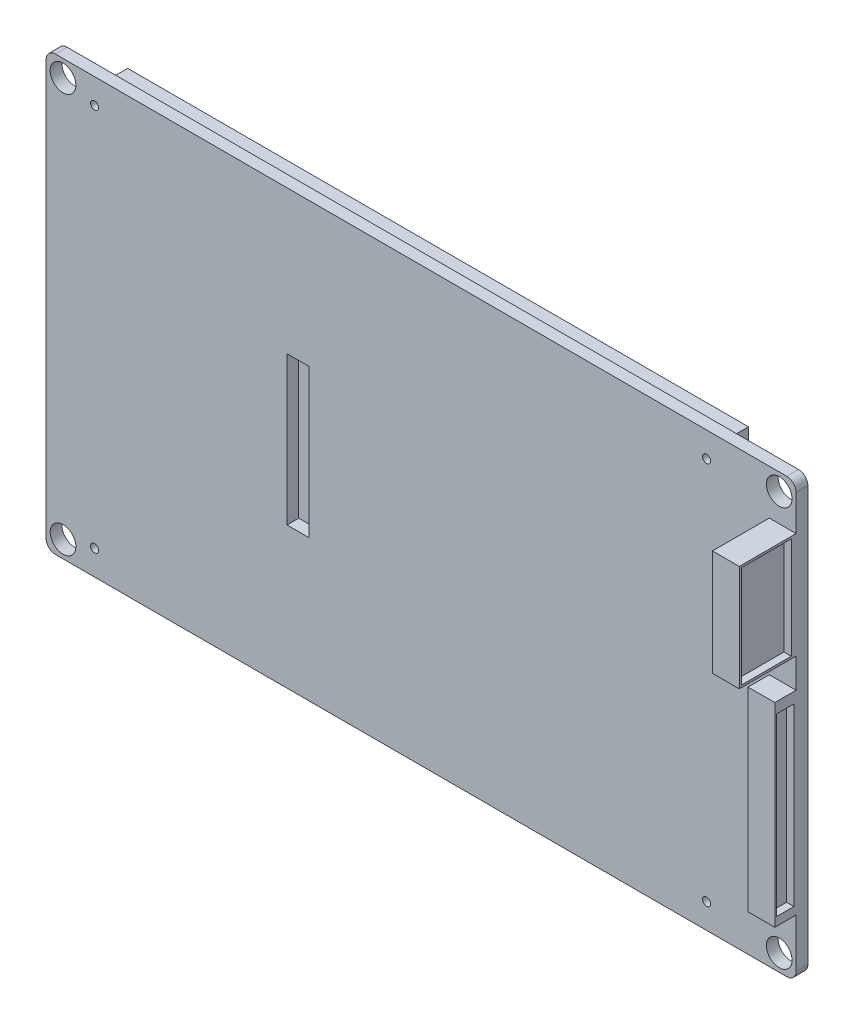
ISO-10303-21;
HEADER;
FILE_DESCRIPTION(('STEP AP214'),'2;1');
FILE_NAME('part.step','',(''),(''),'','','');
FILE_SCHEMA(('AUTOMOTIVE_DESIGN { 1 0 10303 214 1 1 1 1 }'));
ENDSEC;
DATA;
#1=APPLICATION_CONTEXT('core data for automotive mechanical design processes');
#2=APPLICATION_PROTOCOL_DEFINITION('international standard','automotive_design',2000,#1);
#3=PRODUCT_CONTEXT('',#1,'mechanical');
#4=PRODUCT('Part','Part','',(#3));
#5=PRODUCT_RELATED_PRODUCT_CATEGORY('part','',(#4));
#6=PRODUCT_DEFINITION_FORMATION('','',#4);
#7=PRODUCT_DEFINITION_CONTEXT('part definition',#1,'design');
#8=PRODUCT_DEFINITION('design','',#6,#7);
#9=PRODUCT_DEFINITION_SHAPE('','',#8);
#10=(LENGTH_UNIT() NAMED_UNIT(*) SI_UNIT(.MILLI.,.METRE.));
#11=(NAMED_UNIT(*) PLANE_ANGLE_UNIT() SI_UNIT($,.RADIAN.));
#12=(NAMED_UNIT(*) SI_UNIT($,.STERADIAN.) SOLID_ANGLE_UNIT());
#13=UNCERTAINTY_MEASURE_WITH_UNIT(LENGTH_MEASURE(1.E-05),#10,'distance_accuracy_value','');
#14=(GEOMETRIC_REPRESENTATION_CONTEXT(3) GLOBAL_UNCERTAINTY_ASSIGNED_CONTEXT((#13)) GLOBAL_UNIT_ASSIGNED_CONTEXT((#10,
#11,#12)) REPRESENTATION_CONTEXT('',''));
#15=CARTESIAN_POINT('',(0.,0.,0.));
#16=DIRECTION('',(0.,0.,1.));
#17=DIRECTION('',(1.,0.,0.));
#18=AXIS2_PLACEMENT_3D('',#15,#16,#17);
#19=CARTESIAN_POINT('',(0.,0.,1.6));
#20=DIRECTION('',(0.,0.,1.));
#21=DIRECTION('',(1.,0.,0.));
#22=AXIS2_PLACEMENT_3D('',#19,#20,#21);
#23=PLANE('',#22);
#24=CARTESIAN_POINT('',(-99.8000000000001,56.700000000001,1.6));
#25=DIRECTION('',(0.,0.,1.));
#26=DIRECTION('',(1.,0.,0.));
#27=AXIS2_PLACEMENT_3D('',#24,#25,#26);
#28=CIRCLE('',#27,1.74999999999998);
#29=CARTESIAN_POINT('',(-98.0500000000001,56.700000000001,1.6));
#30=VERTEX_POINT('',#29);
#31=EDGE_CURVE('E480',#30,#30,#28,.T.);
#32=ORIENTED_EDGE('',*,*,#31,.F.);
#33=EDGE_LOOP('',(#32));
#34=FACE_BOUND('',#33,.T.);
#35=CARTESIAN_POINT('',(-99.8000000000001,2.30000000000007,1.6));
#36=DIRECTION('',(0.,0.,1.));
#37=DIRECTION('',(1.,0.,0.));
#38=AXIS2_PLACEMENT_3D('',#35,#36,#37);
#39=CIRCLE('',#38,1.75000000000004);
#40=CARTESIAN_POINT('',(-98.05,2.30000000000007,1.6));
#41=VERTEX_POINT('',#40);
#42=EDGE_CURVE('E483',#41,#41,#39,.F.);
#43=ORIENTED_EDGE('',*,*,#42,.T.);
#44=EDGE_LOOP('',(#43));
#45=FACE_BOUND('',#44,.T.);
#46=CARTESIAN_POINT('',(-2.29999999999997,2.30000000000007,1.6));
#47=DIRECTION('',(0.,0.,1.));
#48=DIRECTION('',(1.,0.,0.));
#49=AXIS2_PLACEMENT_3D('',#46,#47,#48);
#50=CIRCLE('',#49,1.75000000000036);
#51=CARTESIAN_POINT('',(-0.549999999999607,2.30000000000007,1.6));
#52=VERTEX_POINT('',#51);
#53=EDGE_CURVE('E486',#52,#52,#50,.T.);
#54=ORIENTED_EDGE('',*,*,#53,.F.);
#55=EDGE_LOOP('',(#54));
#56=FACE_BOUND('',#55,.T.);
#57=CARTESIAN_POINT('',(-2.29999999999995,56.700000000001,1.6));
#58=DIRECTION('',(0.,0.,1.));
#59=DIRECTION('',(1.,0.,0.));
#60=AXIS2_PLACEMENT_3D('',#57,#58,#59);
#61=CIRCLE('',#60,1.75000000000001);
#62=CARTESIAN_POINT('',(-0.549999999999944,56.700000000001,1.6));
#63=VERTEX_POINT('',#62);
#64=EDGE_CURVE('E489',#63,#63,#61,.F.);
#65=ORIENTED_EDGE('',*,*,#64,.T.);
#66=EDGE_LOOP('',(#65));
#67=FACE_BOUND('',#66,.T.);
#68=CARTESIAN_POINT('',(-12.18,3.40000000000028,1.6));
#69=DIRECTION('',(0.,0.,1.));
#70=DIRECTION('',(1.,0.,0.));
#71=AXIS2_PLACEMENT_3D('',#68,#69,#70);
#72=CIRCLE('',#71,0.550000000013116);
#73=CARTESIAN_POINT('',(-11.6299999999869,3.40000000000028,1.6));
#74=VERTEX_POINT('',#73);
#75=EDGE_CURVE('E492',#74,#74,#72,.T.);
#76=ORIENTED_EDGE('',*,*,#75,.F.);
#77=EDGE_LOOP('',(#76));
#78=FACE_BOUND('',#77,.T.);
#79=CARTESIAN_POINT('',(-95.500008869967,3.40000000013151,1.6));
#80=DIRECTION('',(0.,0.,1.));
#81=DIRECTION('',(1.,0.,0.));
#82=AXIS2_PLACEMENT_3D('',#79,#80,#81);
#83=CIRCLE('',#82,0.550000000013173);
#84=CARTESIAN_POINT('',(-94.9500088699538,3.40000000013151,1.6));
#85=VERTEX_POINT('',#84);
#86=EDGE_CURVE('E495',#85,#85,#83,.F.);
#87=ORIENTED_EDGE('',*,*,#86,.T.);
#88=EDGE_LOOP('',(#87));
#89=FACE_BOUND('',#88,.T.);
#90=CARTESIAN_POINT('',(-95.5000088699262,55.6000000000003,1.6));
#91=DIRECTION('',(0.,0.,1.));
#92=DIRECTION('',(1.,0.,0.));
#93=AXIS2_PLACEMENT_3D('',#90,#91,#92);
#94=CIRCLE('',#93,0.550000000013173);
#95=CARTESIAN_POINT('',(-94.950008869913,55.6000000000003,1.6));
#96=VERTEX_POINT('',#95);
#97=EDGE_CURVE('E498',#96,#96,#94,.T.);
#98=ORIENTED_EDGE('',*,*,#97,.F.);
#99=EDGE_LOOP('',(#98));
#100=FACE_BOUND('',#99,.T.);
#101=CARTESIAN_POINT('',(-12.1799999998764,55.599999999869,1.6));
#102=DIRECTION('',(0.,0.,1.));
#103=DIRECTION('',(1.,0.,0.));
#104=AXIS2_PLACEMENT_3D('',#101,#102,#103);
#105=CIRCLE('',#104,0.550000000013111);
#106=CARTESIAN_POINT('',(-11.6299999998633,55.599999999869,1.6));
#107=VERTEX_POINT('',#106);
#108=EDGE_CURVE('E501',#107,#107,#105,.F.);
#109=ORIENTED_EDGE('',*,*,#108,.T.);
#110=EDGE_LOOP('',(#109));
#111=FACE_BOUND('',#110,.T.);
#112=DIRECTION('',(1.,1.29526019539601E-13,0.));
#113=VECTOR('',#112,1.);
#114=CARTESIAN_POINT('',(-5.10850620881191E-12,39.4399999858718,1.6));
#115=LINE('',#114,#113);
#116=CARTESIAN_POINT('',(-69.3099999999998,39.4399999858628,1.6));
#117=VERTEX_POINT('',#116);
#118=CARTESIAN_POINT('',(-66.3099999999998,39.4399999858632,1.6));
#119=VERTEX_POINT('',#118);
#120=EDGE_CURVE('E504',#117,#119,#115,.T.);
#121=ORIENTED_EDGE('',*,*,#120,.T.);
#122=DIRECTION('',(0.,-1.,0.));
#123=VECTOR('',#122,1.);
#124=CARTESIAN_POINT('',(-66.3099999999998,0.,1.6));
#125=LINE('',#124,#123);
#126=CARTESIAN_POINT('',(-66.3099999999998,19.2400000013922,1.6));
#127=VERTEX_POINT('',#126);
#128=EDGE_CURVE('E507',#119,#127,#125,.T.);
#129=ORIENTED_EDGE('',*,*,#128,.T.);
#130=DIRECTION('',(1.,-1.29526019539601E-13,0.));
#131=VECTOR('',#130,1.);
#132=CARTESIAN_POINT('',(2.49208061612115E-12,19.2400000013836,1.6));
#133=LINE('',#132,#131);
#134=CARTESIAN_POINT('',(-69.3099999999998,19.2400000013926,1.6));
#135=VERTEX_POINT('',#134);
#136=EDGE_CURVE('E509',#135,#127,#133,.T.);
#137=ORIENTED_EDGE('',*,*,#136,.F.);
#138=DIRECTION('',(0.,-1.,0.));
#139=VECTOR('',#138,1.);
#140=CARTESIAN_POINT('',(-69.3099999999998,0.,1.6));
#141=LINE('',#140,#139);
#142=EDGE_CURVE('E512',#117,#135,#141,.T.);
#143=ORIENTED_EDGE('',*,*,#142,.F.);
#144=EDGE_LOOP('',(#121,#129,#137,#143));
#145=FACE_BOUND('',#144,.T.);
#146=DIRECTION('',(0.,1.,0.));
#147=VECTOR('',#146,1.);
#148=CARTESIAN_POINT('',(-3.65175148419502,0.,1.6));
#149=LINE('',#148,#147);
#150=CARTESIAN_POINT('',(-3.65175148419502,7.91100000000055,1.6));
#151=VERTEX_POINT('',#150);
#152=CARTESIAN_POINT('',(-3.65175148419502,34.4110000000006,1.6));
#153=VERTEX_POINT('',#152);
#154=EDGE_CURVE('E429',#151,#153,#149,.T.);
#155=ORIENTED_EDGE('',*,*,#154,.T.);
#156=DIRECTION('',(1.,0.,0.));
#157=VECTOR('',#156,1.);
#158=CARTESIAN_POINT('',(0.,34.4110000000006,1.6));
#159=LINE('',#158,#157);
#160=CARTESIAN_POINT('',(0.,34.4110000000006,1.6));
#161=VERTEX_POINT('',#160);
#162=EDGE_CURVE('E432',#153,#161,#159,.T.);
#163=ORIENTED_EDGE('',*,*,#162,.T.);
#164=DIRECTION('',(0.,-1.,0.));
#165=VECTOR('',#164,1.);
#166=CARTESIAN_POINT('',(0.,0.,1.6));
#167=LINE('',#166,#165);
#168=CARTESIAN_POINT('',(0.,38.4500000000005,1.6));
#169=VERTEX_POINT('',#168);
#170=EDGE_CURVE('E470',#169,#161,#167,.T.);
#171=ORIENTED_EDGE('',*,*,#170,.F.);
#172=DIRECTION('',(1.,0.,0.));
#173=VECTOR('',#172,1.);
#174=CARTESIAN_POINT('',(0.,38.4500000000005,1.6));
#175=LINE('',#174,#173);
#176=CARTESIAN_POINT('',(-3.65175148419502,38.4500000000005,1.6));
#177=VERTEX_POINT('',#176);
#178=EDGE_CURVE('E456',#177,#169,#175,.T.);
#179=ORIENTED_EDGE('',*,*,#178,.F.);
#180=DIRECTION('',(0.,1.,0.));
#181=VECTOR('',#180,1.);
#182=CARTESIAN_POINT('',(-3.65175148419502,0.,1.6));
#183=LINE('',#182,#181);
#184=CARTESIAN_POINT('',(-3.65175148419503,52.8800000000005,1.6));
#185=VERTEX_POINT('',#184);
#186=EDGE_CURVE('E459',#177,#185,#183,.T.);
#187=ORIENTED_EDGE('',*,*,#186,.T.);
#188=DIRECTION('',(1.,0.,0.));
#189=VECTOR('',#188,1.);
#190=CARTESIAN_POINT('',(0.,52.8800000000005,1.6));
#191=LINE('',#190,#189);
#192=CARTESIAN_POINT('',(0.,52.8800000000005,1.6));
#193=VERTEX_POINT('',#192);
#194=EDGE_CURVE('E462',#185,#193,#191,.T.);
#195=ORIENTED_EDGE('',*,*,#194,.T.);
#196=CARTESIAN_POINT('',(0.,57.7300000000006,1.6));
#197=VERTEX_POINT('',#196);
#198=EDGE_CURVE('E466',#197,#193,#167,.T.);
#199=ORIENTED_EDGE('',*,*,#198,.F.);
#200=CARTESIAN_POINT('',(-1.27,57.7300000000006,1.6));
#201=DIRECTION('',(0.,0.,1.));
#202=DIRECTION('',(1.,0.,0.));
#203=AXIS2_PLACEMENT_3D('',#200,#201,#202);
#204=CIRCLE('',#203,1.27);
#205=CARTESIAN_POINT('',(-1.27,59.0000000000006,1.6));
#206=VERTEX_POINT('',#205);
#207=EDGE_CURVE('E585',#197,#206,#204,.T.);
#208=ORIENTED_EDGE('',*,*,#207,.T.);
#209=DIRECTION('',(-1.,0.,0.));
#210=VECTOR('',#209,1.);
#211=CARTESIAN_POINT('',(0.,59.0000000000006,1.6));
#212=LINE('',#211,#210);
#213=CARTESIAN_POINT('',(-100.83,59.0000000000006,1.6));
#214=VERTEX_POINT('',#213);
#215=EDGE_CURVE('E469',#206,#214,#212,.T.);
#216=ORIENTED_EDGE('',*,*,#215,.T.);
#217=CARTESIAN_POINT('',(-100.83,57.7300000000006,1.6));
#218=DIRECTION('',(0.,0.,1.));
#219=DIRECTION('',(1.,0.,0.));
#220=AXIS2_PLACEMENT_3D('',#217,#218,#219);
#221=CIRCLE('',#220,1.27);
#222=CARTESIAN_POINT('',(-102.1,57.7300000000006,1.6));
#223=VERTEX_POINT('',#222);
#224=EDGE_CURVE('E587',#214,#223,#221,.T.);
#225=ORIENTED_EDGE('',*,*,#224,.T.);
#226=DIRECTION('',(0.,-1.,0.));
#227=VECTOR('',#226,1.);
#228=CARTESIAN_POINT('',(-102.1,0.,1.6));
#229=LINE('',#228,#227);
#230=CARTESIAN_POINT('',(-102.1,1.26999999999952,1.6));
#231=VERTEX_POINT('',#230);
#232=EDGE_CURVE('E474',#223,#231,#229,.T.);
#233=ORIENTED_EDGE('',*,*,#232,.T.);
#234=CARTESIAN_POINT('',(-100.83,1.26999999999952,1.6));
#235=DIRECTION('',(0.,0.,1.));
#236=DIRECTION('',(1.,0.,0.));
#237=AXIS2_PLACEMENT_3D('',#234,#235,#236);
#238=CIRCLE('',#237,1.27);
#239=CARTESIAN_POINT('',(-100.83,-4.79680774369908E-13,1.6));
#240=VERTEX_POINT('',#239);
#241=EDGE_CURVE('E589',#231,#240,#238,.T.);
#242=ORIENTED_EDGE('',*,*,#241,.T.);
#243=DIRECTION('',(-1.,0.,0.));
#244=VECTOR('',#243,1.);
#245=CARTESIAN_POINT('',(0.,0.,1.6));
#246=LINE('',#245,#244);
#247=CARTESIAN_POINT('',(-1.26999999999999,0.,1.6));
#248=VERTEX_POINT('',#247);
#249=EDGE_CURVE('E477',#248,#240,#246,.T.);
#250=ORIENTED_EDGE('',*,*,#249,.F.);
#251=CARTESIAN_POINT('',(-1.27,1.26999999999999,1.6));
#252=DIRECTION('',(0.,0.,1.));
#253=DIRECTION('',(1.,0.,0.));
#254=AXIS2_PLACEMENT_3D('',#251,#252,#253);
#255=CIRCLE('',#254,1.27);
#256=CARTESIAN_POINT('',(0.,1.26999999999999,1.6));
#257=VERTEX_POINT('',#256);
#258=EDGE_CURVE('E582',#248,#257,#255,.T.);
#259=ORIENTED_EDGE('',*,*,#258,.T.);
#260=CARTESIAN_POINT('',(0.,7.91100000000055,1.6));
#261=VERTEX_POINT('',#260);
#262=EDGE_CURVE('E471',#261,#257,#167,.T.);
#263=ORIENTED_EDGE('',*,*,#262,.F.);
#264=DIRECTION('',(1.,0.,0.));
#265=VECTOR('',#264,1.);
#266=CARTESIAN_POINT('',(0.,7.91100000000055,1.6));
#267=LINE('',#266,#265);
#268=EDGE_CURVE('E426',#151,#261,#267,.T.);
#269=ORIENTED_EDGE('',*,*,#268,.F.);
#270=EDGE_LOOP('',(#155,#163,#171,#179,#187,#195,#199,#208,#216,#225,#233,#242,#250,#259,#263,#269));
#271=FACE_BOUND('',#270,.T.);
#272=ADVANCED_FACE('F36',(#34,#45,#56,#67,#78,#89,#100,#111,#145,#271),#23,.T.);
#273=CARTESIAN_POINT('',(-5.10850620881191E-12,39.4399999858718,1.6));
#274=DIRECTION('',(-1.29526019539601E-13,1.,0.));
#275=DIRECTION('',(-1.,-1.29526019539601E-13,0.));
#276=AXIS2_PLACEMENT_3D('',#273,#274,#275);
#277=PLANE('',#276);
#278=DIRECTION('',(1.,1.29526019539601E-13,0.));
#279=VECTOR('',#278,1.);
#280=CARTESIAN_POINT('',(-5.10850620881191E-12,39.4399999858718,0.));
#281=LINE('',#280,#279);
#282=CARTESIAN_POINT('',(-69.3099999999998,39.4399999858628,0.));
#283=VERTEX_POINT('',#282);
#284=CARTESIAN_POINT('',(-66.3099999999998,39.4399999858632,0.));
#285=VERTEX_POINT('',#284);
#286=EDGE_CURVE('E544',#283,#285,#281,.T.);
#287=ORIENTED_EDGE('',*,*,#286,.T.);
#288=DIRECTION('',(0.,0.,-1.));
#289=VECTOR('',#288,1.);
#290=CARTESIAN_POINT('',(-66.3099999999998,39.4399999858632,1.6));
#291=LINE('',#290,#289);
#292=EDGE_CURVE('E562',#119,#285,#291,.T.);
#293=ORIENTED_EDGE('',*,*,#292,.F.);
#294=ORIENTED_EDGE('',*,*,#120,.F.);
#295=DIRECTION('',(0.,0.,-1.));
#296=VECTOR('',#295,1.);
#297=CARTESIAN_POINT('',(-69.3099999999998,39.4399999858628,1.6));
#298=LINE('',#297,#296);
#299=EDGE_CURVE('E515',#117,#283,#298,.T.);
#300=ORIENTED_EDGE('',*,*,#299,.T.);
#301=EDGE_LOOP('',(#287,#293,#294,#300));
#302=FACE_BOUND('',#301,.T.);
#303=ADVANCED_FACE('F677',(#302),#277,.F.);
#304=CARTESIAN_POINT('',(-66.3099999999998,0.,1.6));
#305=DIRECTION('',(1.,0.,0.));
#306=DIRECTION('',(0.,0.,-1.));
#307=AXIS2_PLACEMENT_3D('',#304,#305,#306);
#308=PLANE('',#307);
#309=DIRECTION('',(0.,-1.,0.));
#310=VECTOR('',#309,1.);
#311=CARTESIAN_POINT('',(-66.3099999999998,0.,0.));
#312=LINE('',#311,#310);
#313=CARTESIAN_POINT('',(-66.3099999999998,19.2400000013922,0.));
#314=VERTEX_POINT('',#313);
#315=EDGE_CURVE('E547',#285,#314,#312,.T.);
#316=ORIENTED_EDGE('',*,*,#315,.T.);
#317=DIRECTION('',(0.,0.,-1.));
#318=VECTOR('',#317,1.);
#319=CARTESIAN_POINT('',(-66.3099999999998,19.2400000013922,1.6));
#320=LINE('',#319,#318);
#321=EDGE_CURVE('E560',#127,#314,#320,.T.);
#322=ORIENTED_EDGE('',*,*,#321,.F.);
#323=ORIENTED_EDGE('',*,*,#128,.F.);
#324=ORIENTED_EDGE('',*,*,#292,.T.);
#325=EDGE_LOOP('',(#316,#322,#323,#324));
#326=FACE_BOUND('',#325,.T.);
#327=ADVANCED_FACE('F683',(#326),#308,.F.);
#328=CARTESIAN_POINT('',(2.49208061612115E-12,19.2400000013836,1.6));
#329=DIRECTION('',(1.29526019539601E-13,1.,0.));
#330=DIRECTION('',(-1.,1.29526019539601E-13,0.));
#331=AXIS2_PLACEMENT_3D('',#328,#329,#330);
#332=PLANE('',#331);
#333=DIRECTION('',(1.,-1.29526019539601E-13,0.));
#334=VECTOR('',#333,1.);
#335=CARTESIAN_POINT('',(2.49208061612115E-12,19.2400000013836,0.));
#336=LINE('',#335,#334);
#337=CARTESIAN_POINT('',(-69.3099999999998,19.2400000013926,0.));
#338=VERTEX_POINT('',#337);
#339=EDGE_CURVE('E550',#338,#314,#336,.T.);
#340=ORIENTED_EDGE('',*,*,#339,.F.);
#341=DIRECTION('',(0.,0.,-1.));
#342=VECTOR('',#341,1.);
#343=CARTESIAN_POINT('',(-69.3099999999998,19.2400000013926,1.6));
#344=LINE('',#343,#342);
#345=EDGE_CURVE('E557',#135,#338,#344,.T.);
#346=ORIENTED_EDGE('',*,*,#345,.F.);
#347=ORIENTED_EDGE('',*,*,#136,.T.);
#348=ORIENTED_EDGE('',*,*,#321,.T.);
#349=EDGE_LOOP('',(#340,#346,#347,#348));
#350=FACE_BOUND('',#349,.T.);
#351=ADVANCED_FACE('F698',(#350),#332,.T.);
#352=CARTESIAN_POINT('',(0.,0.,1.6));
#353=DIRECTION('',(1.,0.,0.));
#354=DIRECTION('',(0.,1.,0.));
#355=AXIS2_PLACEMENT_3D('',#352,#353,#354);
#356=PLANE('',#355);
#357=DIRECTION('',(0.,-1.,0.));
#358=VECTOR('',#357,1.);
#359=CARTESIAN_POINT('',(0.,38.7500000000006,9.04));
#360=LINE('',#359,#358);
#361=CARTESIAN_POINT('',(0.,52.5800000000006,9.04));
#362=VERTEX_POINT('',#361);
#363=CARTESIAN_POINT('',(0.,38.7500000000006,9.04));
#364=VERTEX_POINT('',#363);
#365=EDGE_CURVE('E51',#362,#364,#360,.T.);
#366=ORIENTED_EDGE('',*,*,#365,.F.);
#367=DIRECTION('',(0.,0.,1.));
#368=VECTOR('',#367,1.);
#369=CARTESIAN_POINT('',(0.,52.5800000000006,9.04));
#370=LINE('',#369,#368);
#371=CARTESIAN_POINT('',(0.,52.5800000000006,2.26));
#372=VERTEX_POINT('',#371);
#373=EDGE_CURVE('E288',#372,#362,#370,.T.);
#374=ORIENTED_EDGE('',*,*,#373,.F.);
#375=DIRECTION('',(0.,1.,0.));
#376=VECTOR('',#375,1.);
#377=CARTESIAN_POINT('',(0.,38.7500000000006,2.26));
#378=LINE('',#377,#376);
#379=CARTESIAN_POINT('',(0.,38.7500000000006,2.26));
#380=VERTEX_POINT('',#379);
#381=EDGE_CURVE('E291',#380,#372,#378,.T.);
#382=ORIENTED_EDGE('',*,*,#381,.F.);
#383=DIRECTION('',(0.,0.,-1.));
#384=VECTOR('',#383,1.);
#385=CARTESIAN_POINT('',(0.,38.7500000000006,9.04));
#386=LINE('',#385,#384);
#387=EDGE_CURVE('E297',#364,#380,#386,.T.);
#388=ORIENTED_EDGE('',*,*,#387,.F.);
#389=EDGE_LOOP('',(#366,#374,#382,#388));
#390=FACE_BOUND('',#389,.T.);
#391=DIRECTION('',(0.,-1.,0.));
#392=VECTOR('',#391,1.);
#393=CARTESIAN_POINT('',(0.,9.06100000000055,4.24));
#394=LINE('',#393,#392);
#395=CARTESIAN_POINT('',(0.,32.9510000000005,4.24));
#396=VERTEX_POINT('',#395);
#397=CARTESIAN_POINT('',(0.,9.06100000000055,4.24));
#398=VERTEX_POINT('',#397);
#399=EDGE_CURVE('E59',#396,#398,#394,.T.);
#400=ORIENTED_EDGE('',*,*,#399,.F.);
#401=DIRECTION('',(0.,0.,1.));
#402=VECTOR('',#401,1.);
#403=CARTESIAN_POINT('',(0.,32.9510000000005,4.24));
#404=LINE('',#403,#402);
#405=CARTESIAN_POINT('',(0.,32.9510000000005,1.9));
#406=VERTEX_POINT('',#405);
#407=EDGE_CURVE('E310',#406,#396,#404,.T.);
#408=ORIENTED_EDGE('',*,*,#407,.F.);
#409=DIRECTION('',(0.,1.,0.));
#410=VECTOR('',#409,1.);
#411=CARTESIAN_POINT('',(0.,9.06100000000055,1.9));
#412=LINE('',#411,#410);
#413=CARTESIAN_POINT('',(0.,9.06100000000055,1.9));
#414=VERTEX_POINT('',#413);
#415=EDGE_CURVE('E324',#414,#406,#412,.T.);
#416=ORIENTED_EDGE('',*,*,#415,.F.);
#417=DIRECTION('',(0.,0.,-1.));
#418=VECTOR('',#417,1.);
#419=CARTESIAN_POINT('',(0.,9.06100000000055,4.24));
#420=LINE('',#419,#418);
#421=EDGE_CURVE('E321',#398,#414,#420,.T.);
#422=ORIENTED_EDGE('',*,*,#421,.F.);
#423=EDGE_LOOP('',(#400,#408,#416,#422));
#424=FACE_BOUND('',#423,.T.);
#425=DIRECTION('',(0.,0.,-1.));
#426=VECTOR('',#425,1.);
#427=CARTESIAN_POINT('',(0.,1.26999999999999,1.6));
#428=LINE('',#427,#426);
#429=CARTESIAN_POINT('',(0.,1.26999999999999,0.));
#430=VERTEX_POINT('',#429);
#431=EDGE_CURVE('E44',#257,#430,#428,.T.);
#432=ORIENTED_EDGE('',*,*,#431,.T.);
#433=DIRECTION('',(0.,-1.,0.));
#434=VECTOR('',#433,1.);
#435=CARTESIAN_POINT('',(0.,0.,0.));
#436=LINE('',#435,#434);
#437=CARTESIAN_POINT('',(0.,57.7300000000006,0.));
#438=VERTEX_POINT('',#437);
#439=EDGE_CURVE('E465',#438,#430,#436,.T.);
#440=ORIENTED_EDGE('',*,*,#439,.F.);
#441=DIRECTION('',(0.,0.,-1.));
#442=VECTOR('',#441,1.);
#443=CARTESIAN_POINT('',(0.,57.7300000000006,1.6));
#444=LINE('',#443,#442);
#445=EDGE_CURVE('E11',#438,#197,#444,.F.);
#446=ORIENTED_EDGE('',*,*,#445,.T.);
#447=ORIENTED_EDGE('',*,*,#198,.T.);
#448=DIRECTION('',(0.,0.,-1.));
#449=VECTOR('',#448,1.);
#450=CARTESIAN_POINT('',(0.,52.8800000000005,9.34));
#451=LINE('',#450,#449);
#452=CARTESIAN_POINT('',(0.,52.8800000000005,9.34));
#453=VERTEX_POINT('',#452);
#454=EDGE_CURVE('E446',#453,#193,#451,.T.);
#455=ORIENTED_EDGE('',*,*,#454,.F.);
#456=DIRECTION('',(0.,-1.,0.));
#457=VECTOR('',#456,1.);
#458=CARTESIAN_POINT('',(0.,0.,9.34));
#459=LINE('',#458,#457);
#460=CARTESIAN_POINT('',(0.,38.4500000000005,9.34));
#461=VERTEX_POINT('',#460);
#462=EDGE_CURVE('E443',#453,#461,#459,.T.);
#463=ORIENTED_EDGE('',*,*,#462,.T.);
#464=DIRECTION('',(0.,0.,-1.));
#465=VECTOR('',#464,1.);
#466=CARTESIAN_POINT('',(0.,38.4500000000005,9.34));
#467=LINE('',#466,#465);
#468=EDGE_CURVE('E448',#461,#169,#467,.T.);
#469=ORIENTED_EDGE('',*,*,#468,.T.);
#470=ORIENTED_EDGE('',*,*,#170,.T.);
#471=DIRECTION('',(0.,0.,-1.));
#472=VECTOR('',#471,1.);
#473=CARTESIAN_POINT('',(0.,34.4110000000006,4.5));
#474=LINE('',#473,#472);
#475=CARTESIAN_POINT('',(0.,34.4110000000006,4.5));
#476=VERTEX_POINT('',#475);
#477=EDGE_CURVE('E416',#476,#161,#474,.T.);
#478=ORIENTED_EDGE('',*,*,#477,.F.);
#479=DIRECTION('',(0.,-1.,0.));
#480=VECTOR('',#479,1.);
#481=CARTESIAN_POINT('',(0.,0.,4.5));
#482=LINE('',#481,#480);
#483=CARTESIAN_POINT('',(0.,7.91100000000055,4.5));
#484=VERTEX_POINT('',#483);
#485=EDGE_CURVE('E413',#476,#484,#482,.T.);
#486=ORIENTED_EDGE('',*,*,#485,.T.);
#487=DIRECTION('',(0.,0.,-1.));
#488=VECTOR('',#487,1.);
#489=CARTESIAN_POINT('',(0.,7.91100000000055,4.5));
#490=LINE('',#489,#488);
#491=EDGE_CURVE('E418',#484,#261,#490,.T.);
#492=ORIENTED_EDGE('',*,*,#491,.T.);
#493=ORIENTED_EDGE('',*,*,#262,.T.);
#494=EDGE_LOOP('',(#432,#440,#446,#447,#455,#463,#469,#470,#478,#486,#492,#493));
#495=FACE_BOUND('',#494,.T.);
#496=ADVANCED_FACE('F599',(#390,#424,#495),#356,.T.);
#497=CARTESIAN_POINT('',(0.,59.0000000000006,1.6));
#498=DIRECTION('',(0.,-1.,0.));
#499=DIRECTION('',(1.,0.,0.));
#500=AXIS2_PLACEMENT_3D('',#497,#498,#499);
#501=PLANE('',#500);
#502=DIRECTION('',(-1.,0.,0.));
#503=VECTOR('',#502,1.);
#504=CARTESIAN_POINT('',(0.,59.0000000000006,0.));
#505=LINE('',#504,#503);
#506=CARTESIAN_POINT('',(-1.27,59.0000000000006,0.));
#507=VERTEX_POINT('',#506);
#508=CARTESIAN_POINT('',(-100.83,59.0000000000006,0.));
#509=VERTEX_POINT('',#508);
#510=EDGE_CURVE('E517',#507,#509,#505,.T.);
#511=ORIENTED_EDGE('',*,*,#510,.T.);
#512=DIRECTION('',(0.,0.,-1.));
#513=VECTOR('',#512,1.);
#514=CARTESIAN_POINT('',(-100.83,59.0000000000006,1.6));
#515=LINE('',#514,#513);
#516=EDGE_CURVE('E594',#509,#214,#515,.F.);
#517=ORIENTED_EDGE('',*,*,#516,.T.);
#518=ORIENTED_EDGE('',*,*,#215,.F.);
#519=DIRECTION('',(0.,0.,-1.));
#520=VECTOR('',#519,1.);
#521=CARTESIAN_POINT('',(-1.27,59.0000000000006,0.));
#522=LINE('',#521,#520);
#523=EDGE_CURVE('E591',#206,#507,#522,.T.);
#524=ORIENTED_EDGE('',*,*,#523,.T.);
#525=EDGE_LOOP('',(#511,#517,#518,#524));
#526=FACE_BOUND('',#525,.T.);
#527=ADVANCED_FACE('F629',(#526),#501,.F.);
#528=CARTESIAN_POINT('',(-102.1,0.,1.6));
#529=DIRECTION('',(1.,0.,0.));
#530=DIRECTION('',(0.,1.,0.));
#531=AXIS2_PLACEMENT_3D('',#528,#529,#530);
#532=PLANE('',#531);
#533=DIRECTION('',(0.,-1.,0.));
#534=VECTOR('',#533,1.);
#535=CARTESIAN_POINT('',(-102.1,0.,0.));
#536=LINE('',#535,#534);
#537=CARTESIAN_POINT('',(-102.1,57.7300000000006,0.));
#538=VERTEX_POINT('',#537);
#539=CARTESIAN_POINT('',(-102.1,1.26999999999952,0.));
#540=VERTEX_POINT('',#539);
#541=EDGE_CURVE('E520',#538,#540,#536,.T.);
#542=ORIENTED_EDGE('',*,*,#541,.T.);
#543=DIRECTION('',(0.,0.,-1.));
#544=VECTOR('',#543,1.);
#545=CARTESIAN_POINT('',(-102.1,1.26999999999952,1.6));
#546=LINE('',#545,#544);
#547=EDGE_CURVE('E580',#540,#231,#546,.F.);
#548=ORIENTED_EDGE('',*,*,#547,.T.);
#549=ORIENTED_EDGE('',*,*,#232,.F.);
#550=DIRECTION('',(0.,0.,-1.));
#551=VECTOR('',#550,1.);
#552=CARTESIAN_POINT('',(-102.1,57.7300000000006,1.6));
#553=LINE('',#552,#551);
#554=EDGE_CURVE('E577',#223,#538,#553,.T.);
#555=ORIENTED_EDGE('',*,*,#554,.T.);
#556=EDGE_LOOP('',(#542,#548,#549,#555));
#557=FACE_BOUND('',#556,.T.);
#558=ADVANCED_FACE('F620',(#557),#532,.F.);
#559=CARTESIAN_POINT('',(-12.1799999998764,55.599999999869,1.6));
#560=DIRECTION('',(0.,0.,-1.));
#561=DIRECTION('',(-1.,0.,0.));
#562=AXIS2_PLACEMENT_3D('',#559,#560,#561);
#563=CYLINDRICAL_SURFACE('',#562,0.550000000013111);
#564=ORIENTED_EDGE('',*,*,#108,.F.);
#565=EDGE_LOOP('',(#564));
#566=FACE_BOUND('',#565,.T.);
#567=CARTESIAN_POINT('',(-12.1799999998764,55.599999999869,0.));
#568=DIRECTION('',(0.,0.,1.));
#569=DIRECTION('',(1.,0.,0.));
#570=AXIS2_PLACEMENT_3D('',#567,#568,#569);
#571=CIRCLE('',#570,0.550000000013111);
#572=CARTESIAN_POINT('',(-11.6299999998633,55.599999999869,0.));
#573=VERTEX_POINT('',#572);
#574=EDGE_CURVE('E380',#573,#573,#571,.F.);
#575=ORIENTED_EDGE('',*,*,#574,.T.);
#576=EDGE_LOOP('',(#575));
#577=FACE_BOUND('',#576,.T.);
#578=ADVANCED_FACE('F705',(#566,#577),#563,.F.);
#579=CARTESIAN_POINT('',(-95.5000088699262,55.6000000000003,1.6));
#580=DIRECTION('',(0.,0.,-1.));
#581=DIRECTION('',(-1.,0.,0.));
#582=AXIS2_PLACEMENT_3D('',#579,#580,#581);
#583=CYLINDRICAL_SURFACE('',#582,0.550000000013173);
#584=ORIENTED_EDGE('',*,*,#97,.T.);
#585=EDGE_LOOP('',(#584));
#586=FACE_BOUND('',#585,.T.);
#587=CARTESIAN_POINT('',(-95.5000088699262,55.6000000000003,0.));
#588=DIRECTION('',(0.,0.,1.));
#589=DIRECTION('',(1.,0.,0.));
#590=AXIS2_PLACEMENT_3D('',#587,#588,#589);
#591=CIRCLE('',#590,0.550000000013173);
#592=CARTESIAN_POINT('',(-94.950008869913,55.6000000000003,0.));
#593=VERTEX_POINT('',#592);
#594=EDGE_CURVE('E541',#593,#593,#591,.T.);
#595=ORIENTED_EDGE('',*,*,#594,.F.);
#596=EDGE_LOOP('',(#595));
#597=FACE_BOUND('',#596,.T.);
#598=ADVANCED_FACE('F708',(#586,#597),#583,.F.);
#599=CARTESIAN_POINT('',(-95.500008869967,3.40000000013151,1.6));
#600=DIRECTION('',(0.,0.,-1.));
#601=DIRECTION('',(-1.,0.,0.));
#602=AXIS2_PLACEMENT_3D('',#599,#600,#601);
#603=CYLINDRICAL_SURFACE('',#602,0.550000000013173);
#604=ORIENTED_EDGE('',*,*,#86,.F.);
#605=EDGE_LOOP('',(#604));
#606=FACE_BOUND('',#605,.T.);
#607=CARTESIAN_POINT('',(-95.500008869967,3.40000000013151,0.));
#608=DIRECTION('',(0.,0.,1.));
#609=DIRECTION('',(1.,0.,0.));
#610=AXIS2_PLACEMENT_3D('',#607,#608,#609);
#611=CIRCLE('',#610,0.550000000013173);
#612=CARTESIAN_POINT('',(-94.9500088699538,3.40000000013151,0.));
#613=VERTEX_POINT('',#612);
#614=EDGE_CURVE('E371',#613,#613,#611,.F.);
#615=ORIENTED_EDGE('',*,*,#614,.T.);
#616=EDGE_LOOP('',(#615));
#617=FACE_BOUND('',#616,.T.);
#618=ADVANCED_FACE('F712',(#606,#617),#603,.F.);
#619=CARTESIAN_POINT('',(-12.18,3.40000000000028,1.6));
#620=DIRECTION('',(0.,0.,-1.));
#621=DIRECTION('',(-1.,0.,0.));
#622=AXIS2_PLACEMENT_3D('',#619,#620,#621);
#623=CYLINDRICAL_SURFACE('',#622,0.550000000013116);
#624=ORIENTED_EDGE('',*,*,#75,.T.);
#625=EDGE_LOOP('',(#624));
#626=FACE_BOUND('',#625,.T.);
#627=CARTESIAN_POINT('',(-12.18,3.40000000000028,0.));
#628=DIRECTION('',(0.,0.,1.));
#629=DIRECTION('',(1.,0.,0.));
#630=AXIS2_PLACEMENT_3D('',#627,#628,#629);
#631=CIRCLE('',#630,0.550000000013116);
#632=CARTESIAN_POINT('',(-11.6299999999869,3.40000000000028,0.));
#633=VERTEX_POINT('',#632);
#634=EDGE_CURVE('E538',#633,#633,#631,.T.);
#635=ORIENTED_EDGE('',*,*,#634,.F.);
#636=EDGE_LOOP('',(#635));
#637=FACE_BOUND('',#636,.T.);
#638=ADVANCED_FACE('F716',(#626,#637),#623,.F.);
#639=CARTESIAN_POINT('',(-2.29999999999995,56.700000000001,1.6));
#640=DIRECTION('',(0.,0.,-1.));
#641=DIRECTION('',(-1.,0.,0.));
#642=AXIS2_PLACEMENT_3D('',#639,#640,#641);
#643=CYLINDRICAL_SURFACE('',#642,1.75000000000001);
#644=ORIENTED_EDGE('',*,*,#64,.F.);
#645=EDGE_LOOP('',(#644));
#646=FACE_BOUND('',#645,.T.);
#647=CARTESIAN_POINT('',(-2.29999999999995,56.700000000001,0.));
#648=DIRECTION('',(0.,0.,1.));
#649=DIRECTION('',(1.,0.,0.));
#650=AXIS2_PLACEMENT_3D('',#647,#648,#649);
#651=CIRCLE('',#650,1.75000000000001);
#652=CARTESIAN_POINT('',(-0.549999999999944,56.700000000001,0.));
#653=VERTEX_POINT('',#652);
#654=EDGE_CURVE('E535',#653,#653,#651,.F.);
#655=ORIENTED_EDGE('',*,*,#654,.T.);
#656=EDGE_LOOP('',(#655));
#657=FACE_BOUND('',#656,.T.);
#658=ADVANCED_FACE('F720',(#646,#657),#643,.F.);
#659=CARTESIAN_POINT('',(-2.29999999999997,2.30000000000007,1.6));
#660=DIRECTION('',(0.,0.,-1.));
#661=DIRECTION('',(-1.,0.,0.));
#662=AXIS2_PLACEMENT_3D('',#659,#660,#661);
#663=CYLINDRICAL_SURFACE('',#662,1.75000000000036);
#664=ORIENTED_EDGE('',*,*,#53,.T.);
#665=EDGE_LOOP('',(#664));
#666=FACE_BOUND('',#665,.T.);
#667=CARTESIAN_POINT('',(-2.29999999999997,2.30000000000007,0.));
#668=DIRECTION('',(0.,0.,1.));
#669=DIRECTION('',(1.,0.,0.));
#670=AXIS2_PLACEMENT_3D('',#667,#668,#669);
#671=CIRCLE('',#670,1.75000000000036);
#672=CARTESIAN_POINT('',(-0.549999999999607,2.30000000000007,0.));
#673=VERTEX_POINT('',#672);
#674=EDGE_CURVE('E532',#673,#673,#671,.T.);
#675=ORIENTED_EDGE('',*,*,#674,.F.);
#676=EDGE_LOOP('',(#675));
#677=FACE_BOUND('',#676,.T.);
#678=ADVANCED_FACE('F724',(#666,#677),#663,.F.);
#679=CARTESIAN_POINT('',(-99.8000000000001,2.30000000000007,1.6));
#680=DIRECTION('',(0.,0.,-1.));
#681=DIRECTION('',(-1.,0.,0.));
#682=AXIS2_PLACEMENT_3D('',#679,#680,#681);
#683=CYLINDRICAL_SURFACE('',#682,1.75000000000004);
#684=ORIENTED_EDGE('',*,*,#42,.F.);
#685=EDGE_LOOP('',(#684));
#686=FACE_BOUND('',#685,.T.);
#687=CARTESIAN_POINT('',(-99.8000000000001,2.30000000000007,0.));
#688=DIRECTION('',(0.,0.,1.));
#689=DIRECTION('',(1.,0.,0.));
#690=AXIS2_PLACEMENT_3D('',#687,#688,#689);
#691=CIRCLE('',#690,1.75000000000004);
#692=CARTESIAN_POINT('',(-98.05,2.30000000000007,0.));
#693=VERTEX_POINT('',#692);
#694=EDGE_CURVE('E529',#693,#693,#691,.F.);
#695=ORIENTED_EDGE('',*,*,#694,.T.);
#696=EDGE_LOOP('',(#695));
#697=FACE_BOUND('',#696,.T.);
#698=ADVANCED_FACE('F728',(#686,#697),#683,.F.);
#699=CARTESIAN_POINT('',(-99.8000000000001,56.700000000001,1.6));
#700=DIRECTION('',(0.,0.,-1.));
#701=DIRECTION('',(-1.,0.,0.));
#702=AXIS2_PLACEMENT_3D('',#699,#700,#701);
#703=CYLINDRICAL_SURFACE('',#702,1.74999999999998);
#704=ORIENTED_EDGE('',*,*,#31,.T.);
#705=EDGE_LOOP('',(#704));
#706=FACE_BOUND('',#705,.T.);
#707=CARTESIAN_POINT('',(-99.8000000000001,56.700000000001,0.));
#708=DIRECTION('',(0.,0.,1.));
#709=DIRECTION('',(1.,0.,0.));
#710=AXIS2_PLACEMENT_3D('',#707,#708,#709);
#711=CIRCLE('',#710,1.74999999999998);
#712=CARTESIAN_POINT('',(-98.0500000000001,56.700000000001,0.));
#713=VERTEX_POINT('',#712);
#714=EDGE_CURVE('E526',#713,#713,#711,.T.);
#715=ORIENTED_EDGE('',*,*,#714,.F.);
#716=EDGE_LOOP('',(#715));
#717=FACE_BOUND('',#716,.T.);
#718=ADVANCED_FACE('F732',(#706,#717),#703,.F.);
#719=CARTESIAN_POINT('',(0.,0.,1.6));
#720=DIRECTION('',(0.,-1.,0.));
#721=DIRECTION('',(1.,0.,0.));
#722=AXIS2_PLACEMENT_3D('',#719,#720,#721);
#723=PLANE('',#722);
#724=ORIENTED_EDGE('',*,*,#249,.T.);
#725=DIRECTION('',(0.,0.,-1.));
#726=VECTOR('',#725,1.);
#727=CARTESIAN_POINT('',(-100.83,-4.79680774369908E-13,0.));
#728=LINE('',#727,#726);
#729=CARTESIAN_POINT('',(-100.83,-4.79680774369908E-13,0.));
#730=VERTEX_POINT('',#729);
#731=EDGE_CURVE('E566',#240,#730,#728,.T.);
#732=ORIENTED_EDGE('',*,*,#731,.T.);
#733=DIRECTION('',(-1.,0.,0.));
#734=VECTOR('',#733,1.);
#735=CARTESIAN_POINT('',(0.,0.,0.));
#736=LINE('',#735,#734);
#737=CARTESIAN_POINT('',(-1.26999999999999,0.,0.));
#738=VERTEX_POINT('',#737);
#739=EDGE_CURVE('E523',#738,#730,#736,.T.);
#740=ORIENTED_EDGE('',*,*,#739,.F.);
#741=DIRECTION('',(0.,0.,-1.));
#742=VECTOR('',#741,1.);
#743=CARTESIAN_POINT('',(-1.26999999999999,0.,1.6));
#744=LINE('',#743,#742);
#745=EDGE_CURVE('E564',#738,#248,#744,.F.);
#746=ORIENTED_EDGE('',*,*,#745,.T.);
#747=EDGE_LOOP('',(#724,#732,#740,#746));
#748=FACE_BOUND('',#747,.T.);
#749=ADVANCED_FACE('F611',(#748),#723,.T.);
#750=CARTESIAN_POINT('',(-69.3099999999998,0.,1.6));
#751=DIRECTION('',(1.,0.,0.));
#752=DIRECTION('',(0.,0.,-1.));
#753=AXIS2_PLACEMENT_3D('',#750,#751,#752);
#754=PLANE('',#753);
#755=DIRECTION('',(0.,-1.,0.));
#756=VECTOR('',#755,1.);
#757=CARTESIAN_POINT('',(-69.3099999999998,0.,0.));
#758=LINE('',#757,#756);
#759=EDGE_CURVE('E553',#283,#338,#758,.T.);
#760=ORIENTED_EDGE('',*,*,#759,.F.);
#761=ORIENTED_EDGE('',*,*,#299,.F.);
#762=ORIENTED_EDGE('',*,*,#142,.T.);
#763=ORIENTED_EDGE('',*,*,#345,.T.);
#764=EDGE_LOOP('',(#760,#761,#762,#763));
#765=FACE_BOUND('',#764,.T.);
#766=ADVANCED_FACE('F693',(#765),#754,.T.);
#767=CARTESIAN_POINT('',(0.,0.,0.));
#768=DIRECTION('',(0.,0.,1.));
#769=DIRECTION('',(1.,0.,0.));
#770=AXIS2_PLACEMENT_3D('',#767,#768,#769);
#771=PLANE('',#770);
#772=DIRECTION('',(0.,1.,0.));
#773=VECTOR('',#772,1.);
#774=CARTESIAN_POINT('',(-96.1,0.,0.));
#775=LINE('',#774,#773);
#776=CARTESIAN_POINT('',(-96.1,1.87000000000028,0.));
#777=VERTEX_POINT('',#776);
#778=CARTESIAN_POINT('',(-96.1,57.1300000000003,0.));
#779=VERTEX_POINT('',#778);
#780=EDGE_CURVE('E340',#777,#779,#775,.T.);
#781=ORIENTED_EDGE('',*,*,#780,.F.);
#782=DIRECTION('',(1.,0.,0.));
#783=VECTOR('',#782,1.);
#784=CARTESIAN_POINT('',(0.,1.87000000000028,0.));
#785=LINE('',#784,#783);
#786=CARTESIAN_POINT('',(-11.58,1.87000000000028,0.));
#787=VERTEX_POINT('',#786);
#788=EDGE_CURVE('E331',#777,#787,#785,.T.);
#789=ORIENTED_EDGE('',*,*,#788,.T.);
#790=DIRECTION('',(0.,1.,0.));
#791=VECTOR('',#790,1.);
#792=CARTESIAN_POINT('',(-11.58,0.,0.));
#793=LINE('',#792,#791);
#794=CARTESIAN_POINT('',(-11.58,57.1300000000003,0.));
#795=VERTEX_POINT('',#794);
#796=EDGE_CURVE('E362',#787,#795,#793,.T.);
#797=ORIENTED_EDGE('',*,*,#796,.T.);
#798=DIRECTION('',(1.,0.,0.));
#799=VECTOR('',#798,1.);
#800=CARTESIAN_POINT('',(0.,57.1300000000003,0.));
#801=LINE('',#800,#799);
#802=EDGE_CURVE('E365',#779,#795,#801,.T.);
#803=ORIENTED_EDGE('',*,*,#802,.F.);
#804=EDGE_LOOP('',(#781,#789,#797,#803));
#805=FACE_BOUND('',#804,.T.);
#806=ORIENTED_EDGE('',*,*,#439,.T.);
#807=CARTESIAN_POINT('',(-1.27,1.26999999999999,0.));
#808=DIRECTION('',(0.,0.,1.));
#809=DIRECTION('',(1.,0.,0.));
#810=AXIS2_PLACEMENT_3D('',#807,#808,#809);
#811=CIRCLE('',#810,1.27);
#812=EDGE_CURVE('E569',#430,#738,#811,.F.);
#813=ORIENTED_EDGE('',*,*,#812,.T.);
#814=ORIENTED_EDGE('',*,*,#739,.T.);
#815=CARTESIAN_POINT('',(-100.83,1.26999999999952,0.));
#816=DIRECTION('',(0.,0.,1.));
#817=DIRECTION('',(1.,0.,0.));
#818=AXIS2_PLACEMENT_3D('',#815,#816,#817);
#819=CIRCLE('',#818,1.27);
#820=EDGE_CURVE('E575',#730,#540,#819,.F.);
#821=ORIENTED_EDGE('',*,*,#820,.T.);
#822=ORIENTED_EDGE('',*,*,#541,.F.);
#823=CARTESIAN_POINT('',(-100.83,57.7300000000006,0.));
#824=DIRECTION('',(0.,0.,1.));
#825=DIRECTION('',(1.,0.,0.));
#826=AXIS2_PLACEMENT_3D('',#823,#824,#825);
#827=CIRCLE('',#826,1.27);
#828=EDGE_CURVE('E573',#538,#509,#827,.F.);
#829=ORIENTED_EDGE('',*,*,#828,.T.);
#830=ORIENTED_EDGE('',*,*,#510,.F.);
#831=CARTESIAN_POINT('',(-1.27,57.7300000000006,0.));
#832=DIRECTION('',(0.,0.,1.));
#833=DIRECTION('',(1.,0.,0.));
#834=AXIS2_PLACEMENT_3D('',#831,#832,#833);
#835=CIRCLE('',#834,1.27);
#836=EDGE_CURVE('E571',#507,#438,#835,.F.);
#837=ORIENTED_EDGE('',*,*,#836,.T.);
#838=EDGE_LOOP('',(#806,#813,#814,#821,#822,#829,#830,#837));
#839=FACE_BOUND('',#838,.T.);
#840=ORIENTED_EDGE('',*,*,#714,.T.);
#841=EDGE_LOOP('',(#840));
#842=FACE_BOUND('',#841,.T.);
#843=ORIENTED_EDGE('',*,*,#694,.F.);
#844=EDGE_LOOP('',(#843));
#845=FACE_BOUND('',#844,.T.);
#846=ORIENTED_EDGE('',*,*,#674,.T.);
#847=EDGE_LOOP('',(#846));
#848=FACE_BOUND('',#847,.T.);
#849=ORIENTED_EDGE('',*,*,#654,.F.);
#850=EDGE_LOOP('',(#849));
#851=FACE_BOUND('',#850,.T.);
#852=ADVANCED_FACE('F608',(#805,#839,#842,#845,#848,#851),#771,.F.);
#853=CARTESIAN_POINT('',(-100.83,1.26999999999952,1.6));
#854=DIRECTION('',(0.,0.,1.));
#855=DIRECTION('',(1.,0.,0.));
#856=AXIS2_PLACEMENT_3D('',#853,#854,#855);
#857=CYLINDRICAL_SURFACE('',#856,1.27);
#858=ORIENTED_EDGE('',*,*,#241,.F.);
#859=ORIENTED_EDGE('',*,*,#547,.F.);
#860=ORIENTED_EDGE('',*,*,#820,.F.);
#861=ORIENTED_EDGE('',*,*,#731,.F.);
#862=EDGE_LOOP('',(#858,#859,#860,#861));
#863=FACE_BOUND('',#862,.T.);
#864=ADVANCED_FACE('F616',(#863),#857,.T.);
#865=CARTESIAN_POINT('',(-100.83,57.7300000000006,1.6));
#866=DIRECTION('',(0.,0.,-1.));
#867=DIRECTION('',(-1.,0.,0.));
#868=AXIS2_PLACEMENT_3D('',#865,#866,#867);
#869=CYLINDRICAL_SURFACE('',#868,1.27);
#870=ORIENTED_EDGE('',*,*,#224,.F.);
#871=ORIENTED_EDGE('',*,*,#516,.F.);
#872=ORIENTED_EDGE('',*,*,#828,.F.);
#873=ORIENTED_EDGE('',*,*,#554,.F.);
#874=EDGE_LOOP('',(#870,#871,#872,#873));
#875=FACE_BOUND('',#874,.T.);
#876=ADVANCED_FACE('F625',(#875),#869,.T.);
#877=CARTESIAN_POINT('',(-1.27,57.7300000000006,1.6));
#878=DIRECTION('',(0.,0.,1.));
#879=DIRECTION('',(1.,0.,0.));
#880=AXIS2_PLACEMENT_3D('',#877,#878,#879);
#881=CYLINDRICAL_SURFACE('',#880,1.27);
#882=ORIENTED_EDGE('',*,*,#207,.F.);
#883=ORIENTED_EDGE('',*,*,#445,.F.);
#884=ORIENTED_EDGE('',*,*,#836,.F.);
#885=ORIENTED_EDGE('',*,*,#523,.F.);
#886=EDGE_LOOP('',(#882,#883,#884,#885));
#887=FACE_BOUND('',#886,.T.);
#888=ADVANCED_FACE('F634',(#887),#881,.T.);
#889=CARTESIAN_POINT('',(-1.27,1.26999999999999,1.6));
#890=DIRECTION('',(0.,0.,-1.));
#891=DIRECTION('',(-1.,0.,0.));
#892=AXIS2_PLACEMENT_3D('',#889,#890,#891);
#893=CYLINDRICAL_SURFACE('',#892,1.27);
#894=ORIENTED_EDGE('',*,*,#258,.F.);
#895=ORIENTED_EDGE('',*,*,#745,.F.);
#896=ORIENTED_EDGE('',*,*,#812,.F.);
#897=ORIENTED_EDGE('',*,*,#431,.F.);
#898=EDGE_LOOP('',(#894,#895,#896,#897));
#899=FACE_BOUND('',#898,.T.);
#900=ADVANCED_FACE('F38',(#899),#893,.T.);
#901=CARTESIAN_POINT('',(0.,52.8800000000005,9.34));
#902=DIRECTION('',(0.,-1.,0.));
#903=DIRECTION('',(0.,0.,-1.));
#904=AXIS2_PLACEMENT_3D('',#901,#902,#903);
#905=PLANE('',#904);
#906=ORIENTED_EDGE('',*,*,#194,.F.);
#907=DIRECTION('',(0.,0.,-1.));
#908=VECTOR('',#907,1.);
#909=CARTESIAN_POINT('',(-3.65175148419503,52.8800000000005,9.34));
#910=LINE('',#909,#908);
#911=CARTESIAN_POINT('',(-3.65175148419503,52.8800000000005,9.34));
#912=VERTEX_POINT('',#911);
#913=EDGE_CURVE('E453',#912,#185,#910,.T.);
#914=ORIENTED_EDGE('',*,*,#913,.F.);
#915=DIRECTION('',(-1.,0.,0.));
#916=VECTOR('',#915,1.);
#917=CARTESIAN_POINT('',(0.,52.8800000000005,9.34));
#918=LINE('',#917,#916);
#919=EDGE_CURVE('E435',#453,#912,#918,.T.);
#920=ORIENTED_EDGE('',*,*,#919,.F.);
#921=ORIENTED_EDGE('',*,*,#454,.T.);
#922=EDGE_LOOP('',(#906,#914,#920,#921));
#923=FACE_BOUND('',#922,.T.);
#924=ADVANCED_FACE('F640',(#923),#905,.F.);
#925=CARTESIAN_POINT('',(-3.65175148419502,0.,9.34));
#926=DIRECTION('',(1.,0.,0.));
#927=DIRECTION('',(0.,1.,0.));
#928=AXIS2_PLACEMENT_3D('',#925,#926,#927);
#929=PLANE('',#928);
#930=ORIENTED_EDGE('',*,*,#186,.F.);
#931=DIRECTION('',(0.,0.,-1.));
#932=VECTOR('',#931,1.);
#933=CARTESIAN_POINT('',(-3.65175148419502,38.4500000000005,9.34));
#934=LINE('',#933,#932);
#935=CARTESIAN_POINT('',(-3.65175148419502,38.4500000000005,9.34));
#936=VERTEX_POINT('',#935);
#937=EDGE_CURVE('E450',#936,#177,#934,.T.);
#938=ORIENTED_EDGE('',*,*,#937,.F.);
#939=DIRECTION('',(0.,-1.,0.));
#940=VECTOR('',#939,1.);
#941=CARTESIAN_POINT('',(-3.65175148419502,0.,9.34));
#942=LINE('',#941,#940);
#943=EDGE_CURVE('E438',#912,#936,#942,.T.);
#944=ORIENTED_EDGE('',*,*,#943,.F.);
#945=ORIENTED_EDGE('',*,*,#913,.T.);
#946=EDGE_LOOP('',(#930,#938,#944,#945));
#947=FACE_BOUND('',#946,.T.);
#948=ADVANCED_FACE('F643',(#947),#929,.F.);
#949=CARTESIAN_POINT('',(0.,38.4500000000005,9.34));
#950=DIRECTION('',(0.,-1.,0.));
#951=DIRECTION('',(0.,0.,-1.));
#952=AXIS2_PLACEMENT_3D('',#949,#950,#951);
#953=PLANE('',#952);
#954=ORIENTED_EDGE('',*,*,#937,.T.);
#955=ORIENTED_EDGE('',*,*,#178,.T.);
#956=ORIENTED_EDGE('',*,*,#468,.F.);
#957=DIRECTION('',(-1.,0.,0.));
#958=VECTOR('',#957,1.);
#959=CARTESIAN_POINT('',(0.,38.4500000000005,9.34));
#960=LINE('',#959,#958);
#961=EDGE_CURVE('E440',#461,#936,#960,.T.);
#962=ORIENTED_EDGE('',*,*,#961,.T.);
#963=EDGE_LOOP('',(#954,#955,#956,#962));
#964=FACE_BOUND('',#963,.T.);
#965=ADVANCED_FACE('F652',(#964),#953,.T.);
#966=CARTESIAN_POINT('',(0.,0.,9.34));
#967=DIRECTION('',(0.,0.,1.));
#968=DIRECTION('',(1.,0.,0.));
#969=AXIS2_PLACEMENT_3D('',#966,#967,#968);
#970=PLANE('',#969);
#971=ORIENTED_EDGE('',*,*,#919,.T.);
#972=ORIENTED_EDGE('',*,*,#943,.T.);
#973=ORIENTED_EDGE('',*,*,#961,.F.);
#974=ORIENTED_EDGE('',*,*,#462,.F.);
#975=EDGE_LOOP('',(#971,#972,#973,#974));
#976=FACE_BOUND('',#975,.T.);
#977=ADVANCED_FACE('F648',(#976),#970,.T.);
#978=CARTESIAN_POINT('',(0.,34.4110000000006,4.5));
#979=DIRECTION('',(0.,-1.,0.));
#980=DIRECTION('',(0.,0.,-1.));
#981=AXIS2_PLACEMENT_3D('',#978,#979,#980);
#982=PLANE('',#981);
#983=ORIENTED_EDGE('',*,*,#162,.F.);
#984=DIRECTION('',(0.,0.,-1.));
#985=VECTOR('',#984,1.);
#986=CARTESIAN_POINT('',(-3.65175148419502,34.4110000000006,4.5));
#987=LINE('',#986,#985);
#988=CARTESIAN_POINT('',(-3.65175148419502,34.4110000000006,4.5));
#989=VERTEX_POINT('',#988);
#990=EDGE_CURVE('E423',#989,#153,#987,.T.);
#991=ORIENTED_EDGE('',*,*,#990,.F.);
#992=DIRECTION('',(-1.,0.,0.));
#993=VECTOR('',#992,1.);
#994=CARTESIAN_POINT('',(0.,34.4110000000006,4.5));
#995=LINE('',#994,#993);
#996=EDGE_CURVE('E397',#476,#989,#995,.T.);
#997=ORIENTED_EDGE('',*,*,#996,.F.);
#998=ORIENTED_EDGE('',*,*,#477,.T.);
#999=EDGE_LOOP('',(#983,#991,#997,#998));
#1000=FACE_BOUND('',#999,.T.);
#1001=ADVANCED_FACE('F656',(#1000),#982,.F.);
#1002=CARTESIAN_POINT('',(-3.65175148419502,0.,4.5));
#1003=DIRECTION('',(1.,0.,0.));
#1004=DIRECTION('',(0.,1.,0.));
#1005=AXIS2_PLACEMENT_3D('',#1002,#1003,#1004);
#1006=PLANE('',#1005);
#1007=ORIENTED_EDGE('',*,*,#154,.F.);
#1008=DIRECTION('',(0.,0.,-1.));
#1009=VECTOR('',#1008,1.);
#1010=CARTESIAN_POINT('',(-3.65175148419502,7.91100000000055,4.5));
#1011=LINE('',#1010,#1009);
#1012=CARTESIAN_POINT('',(-3.65175148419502,7.91100000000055,4.5));
#1013=VERTEX_POINT('',#1012);
#1014=EDGE_CURVE('E420',#1013,#151,#1011,.T.);
#1015=ORIENTED_EDGE('',*,*,#1014,.F.);
#1016=DIRECTION('',(0.,-1.,0.));
#1017=VECTOR('',#1016,1.);
#1018=CARTESIAN_POINT('',(-3.65175148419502,0.,4.5));
#1019=LINE('',#1018,#1017);
#1020=EDGE_CURVE('E408',#989,#1013,#1019,.T.);
#1021=ORIENTED_EDGE('',*,*,#1020,.F.);
#1022=ORIENTED_EDGE('',*,*,#990,.T.);
#1023=EDGE_LOOP('',(#1007,#1015,#1021,#1022));
#1024=FACE_BOUND('',#1023,.T.);
#1025=ADVANCED_FACE('F659',(#1024),#1006,.F.);
#1026=CARTESIAN_POINT('',(0.,7.91100000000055,4.5));
#1027=DIRECTION('',(0.,-1.,0.));
#1028=DIRECTION('',(0.,0.,-1.));
#1029=AXIS2_PLACEMENT_3D('',#1026,#1027,#1028);
#1030=PLANE('',#1029);
#1031=ORIENTED_EDGE('',*,*,#1014,.T.);
#1032=ORIENTED_EDGE('',*,*,#268,.T.);
#1033=ORIENTED_EDGE('',*,*,#491,.F.);
#1034=DIRECTION('',(-1.,0.,0.));
#1035=VECTOR('',#1034,1.);
#1036=CARTESIAN_POINT('',(0.,7.91100000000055,4.5));
#1037=LINE('',#1036,#1035);
#1038=EDGE_CURVE('E410',#484,#1013,#1037,.T.);
#1039=ORIENTED_EDGE('',*,*,#1038,.T.);
#1040=EDGE_LOOP('',(#1031,#1032,#1033,#1039));
#1041=FACE_BOUND('',#1040,.T.);
#1042=ADVANCED_FACE('F666',(#1041),#1030,.T.);
#1043=CARTESIAN_POINT('',(0.,0.,4.5));
#1044=DIRECTION('',(0.,0.,1.));
#1045=DIRECTION('',(1.,0.,0.));
#1046=AXIS2_PLACEMENT_3D('',#1043,#1044,#1045);
#1047=PLANE('',#1046);
#1048=ORIENTED_EDGE('',*,*,#996,.T.);
#1049=ORIENTED_EDGE('',*,*,#1020,.T.);
#1050=ORIENTED_EDGE('',*,*,#1038,.F.);
#1051=ORIENTED_EDGE('',*,*,#485,.F.);
#1052=EDGE_LOOP('',(#1048,#1049,#1050,#1051));
#1053=FACE_BOUND('',#1052,.T.);
#1054=ADVANCED_FACE('F664',(#1053),#1047,.T.);
#1055=CARTESIAN_POINT('',(0.,0.,0.));
#1056=DIRECTION('',(0.,0.,1.));
#1057=DIRECTION('',(1.,0.,0.));
#1058=AXIS2_PLACEMENT_3D('',#1055,#1056,#1057);
#1059=PLANE('',#1058);
#1060=ORIENTED_EDGE('',*,*,#286,.F.);
#1061=ORIENTED_EDGE('',*,*,#759,.T.);
#1062=ORIENTED_EDGE('',*,*,#339,.T.);
#1063=ORIENTED_EDGE('',*,*,#315,.F.);
#1064=EDGE_LOOP('',(#1060,#1061,#1062,#1063));
#1065=FACE_BOUND('',#1064,.T.);
#1066=ADVANCED_FACE('F673',(#1065),#1059,.T.);
#1067=CARTESIAN_POINT('',(0.,0.,-3.5));
#1068=DIRECTION('',(0.,0.,1.));
#1069=DIRECTION('',(1.,0.,0.));
#1070=AXIS2_PLACEMENT_3D('',#1067,#1068,#1069);
#1071=PLANE('',#1070);
#1072=DIRECTION('',(0.,1.,0.));
#1073=VECTOR('',#1072,1.);
#1074=CARTESIAN_POINT('',(-14.3299998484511,0.,-3.5));
#1075=LINE('',#1074,#1073);
#1076=CARTESIAN_POINT('',(-14.3299998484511,5.01999999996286,-3.5));
#1077=VERTEX_POINT('',#1076);
#1078=CARTESIAN_POINT('',(-14.3299998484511,53.980000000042,-3.5));
#1079=VERTEX_POINT('',#1078);
#1080=EDGE_CURVE('E337',#1077,#1079,#1075,.T.);
#1081=ORIENTED_EDGE('',*,*,#1080,.T.);
#1082=DIRECTION('',(1.,0.,0.));
#1083=VECTOR('',#1082,1.);
#1084=CARTESIAN_POINT('',(0.,53.980000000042,-3.5));
#1085=LINE('',#1084,#1083);
#1086=CARTESIAN_POINT('',(-87.7699998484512,53.980000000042,-3.5));
#1087=VERTEX_POINT('',#1086);
#1088=EDGE_CURVE('E345',#1087,#1079,#1085,.T.);
#1089=ORIENTED_EDGE('',*,*,#1088,.F.);
#1090=DIRECTION('',(0.,1.,0.));
#1091=VECTOR('',#1090,1.);
#1092=CARTESIAN_POINT('',(-87.7699998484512,0.,-3.5));
#1093=LINE('',#1092,#1091);
#1094=CARTESIAN_POINT('',(-87.7699998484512,5.01999999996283,-3.5));
#1095=VERTEX_POINT('',#1094);
#1096=EDGE_CURVE('E342',#1095,#1087,#1093,.T.);
#1097=ORIENTED_EDGE('',*,*,#1096,.F.);
#1098=DIRECTION('',(1.,0.,0.));
#1099=VECTOR('',#1098,1.);
#1100=CARTESIAN_POINT('',(0.,5.01999999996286,-3.5));
#1101=LINE('',#1100,#1099);
#1102=EDGE_CURVE('E339',#1095,#1077,#1101,.T.);
#1103=ORIENTED_EDGE('',*,*,#1102,.T.);
#1104=EDGE_LOOP('',(#1081,#1089,#1097,#1103));
#1105=FACE_BOUND('',#1104,.T.);
#1106=DIRECTION('',(1.,0.,0.));
#1107=VECTOR('',#1106,1.);
#1108=CARTESIAN_POINT('',(0.,1.87000000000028,-3.5));
#1109=LINE('',#1108,#1107);
#1110=CARTESIAN_POINT('',(-96.1,1.87000000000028,-3.5));
#1111=VERTEX_POINT('',#1110);
#1112=CARTESIAN_POINT('',(-11.58,1.87000000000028,-3.5));
#1113=VERTEX_POINT('',#1112);
#1114=EDGE_CURVE('E348',#1111,#1113,#1109,.T.);
#1115=ORIENTED_EDGE('',*,*,#1114,.F.);
#1116=DIRECTION('',(0.,1.,0.));
#1117=VECTOR('',#1116,1.);
#1118=CARTESIAN_POINT('',(-96.1,0.,-3.5));
#1119=LINE('',#1118,#1117);
#1120=CARTESIAN_POINT('',(-96.1,57.1300000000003,-3.5));
#1121=VERTEX_POINT('',#1120);
#1122=EDGE_CURVE('E356',#1111,#1121,#1119,.T.);
#1123=ORIENTED_EDGE('',*,*,#1122,.T.);
#1124=DIRECTION('',(1.,0.,0.));
#1125=VECTOR('',#1124,1.);
#1126=CARTESIAN_POINT('',(0.,57.1300000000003,-3.5));
#1127=LINE('',#1126,#1125);
#1128=CARTESIAN_POINT('',(-11.58,57.1300000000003,-3.5));
#1129=VERTEX_POINT('',#1128);
#1130=EDGE_CURVE('E354',#1121,#1129,#1127,.T.);
#1131=ORIENTED_EDGE('',*,*,#1130,.T.);
#1132=DIRECTION('',(0.,1.,0.));
#1133=VECTOR('',#1132,1.);
#1134=CARTESIAN_POINT('',(-11.58,0.,-3.5));
#1135=LINE('',#1134,#1133);
#1136=EDGE_CURVE('E351',#1113,#1129,#1135,.T.);
#1137=ORIENTED_EDGE('',*,*,#1136,.F.);
#1138=EDGE_LOOP('',(#1115,#1123,#1131,#1137));
#1139=FACE_BOUND('',#1138,.T.);
#1140=ADVANCED_FACE('F835',(#1105,#1139),#1071,.F.);
#1141=CARTESIAN_POINT('',(-11.58,0.,-3.5));
#1142=DIRECTION('',(1.,0.,0.));
#1143=DIRECTION('',(0.,0.,-1.));
#1144=AXIS2_PLACEMENT_3D('',#1141,#1142,#1143);
#1145=PLANE('',#1144);
#1146=ORIENTED_EDGE('',*,*,#796,.F.);
#1147=DIRECTION('',(0.,0.,1.));
#1148=VECTOR('',#1147,1.);
#1149=CARTESIAN_POINT('',(-11.58,1.87000000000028,-3.5));
#1150=LINE('',#1149,#1148);
#1151=EDGE_CURVE('E359',#1113,#787,#1150,.T.);
#1152=ORIENTED_EDGE('',*,*,#1151,.F.);
#1153=ORIENTED_EDGE('',*,*,#1136,.T.);
#1154=DIRECTION('',(0.,0.,1.));
#1155=VECTOR('',#1154,1.);
#1156=CARTESIAN_POINT('',(-11.58,57.1300000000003,-3.5));
#1157=LINE('',#1156,#1155);
#1158=EDGE_CURVE('E374',#1129,#795,#1157,.T.);
#1159=ORIENTED_EDGE('',*,*,#1158,.T.);
#1160=EDGE_LOOP('',(#1146,#1152,#1153,#1159));
#1161=FACE_BOUND('',#1160,.T.);
#1162=ADVANCED_FACE('F854',(#1161),#1145,.T.);
#1163=CARTESIAN_POINT('',(0.,57.1300000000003,-3.5));
#1164=DIRECTION('',(0.,-1.,0.));
#1165=DIRECTION('',(0.,0.,-1.));
#1166=AXIS2_PLACEMENT_3D('',#1163,#1164,#1165);
#1167=PLANE('',#1166);
#1168=ORIENTED_EDGE('',*,*,#802,.T.);
#1169=ORIENTED_EDGE('',*,*,#1158,.F.);
#1170=ORIENTED_EDGE('',*,*,#1130,.F.);
#1171=DIRECTION('',(0.,0.,1.));
#1172=VECTOR('',#1171,1.);
#1173=CARTESIAN_POINT('',(-96.1,57.1300000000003,-3.5));
#1174=LINE('',#1173,#1172);
#1175=EDGE_CURVE('E372',#1121,#779,#1174,.T.);
#1176=ORIENTED_EDGE('',*,*,#1175,.T.);
#1177=EDGE_LOOP('',(#1168,#1169,#1170,#1176));
#1178=FACE_BOUND('',#1177,.T.);
#1179=ADVANCED_FACE('F865',(#1178),#1167,.F.);
#1180=CARTESIAN_POINT('',(-96.1,0.,-3.5));
#1181=DIRECTION('',(1.,0.,0.));
#1182=DIRECTION('',(0.,1.,0.));
#1183=AXIS2_PLACEMENT_3D('',#1180,#1181,#1182);
#1184=PLANE('',#1183);
#1185=ORIENTED_EDGE('',*,*,#780,.T.);
#1186=ORIENTED_EDGE('',*,*,#1175,.F.);
#1187=ORIENTED_EDGE('',*,*,#1122,.F.);
#1188=DIRECTION('',(0.,0.,1.));
#1189=VECTOR('',#1188,1.);
#1190=CARTESIAN_POINT('',(-96.1,1.87000000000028,-3.5));
#1191=LINE('',#1190,#1189);
#1192=EDGE_CURVE('E369',#1111,#777,#1191,.T.);
#1193=ORIENTED_EDGE('',*,*,#1192,.T.);
#1194=EDGE_LOOP('',(#1185,#1186,#1187,#1193));
#1195=FACE_BOUND('',#1194,.T.);
#1196=ADVANCED_FACE('F876',(#1195),#1184,.F.);
#1197=CARTESIAN_POINT('',(0.,1.87000000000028,-3.5));
#1198=DIRECTION('',(0.,-1.,0.));
#1199=DIRECTION('',(0.,0.,-1.));
#1200=AXIS2_PLACEMENT_3D('',#1197,#1198,#1199);
#1201=PLANE('',#1200);
#1202=ORIENTED_EDGE('',*,*,#788,.F.);
#1203=ORIENTED_EDGE('',*,*,#1192,.F.);
#1204=ORIENTED_EDGE('',*,*,#1114,.T.);
#1205=ORIENTED_EDGE('',*,*,#1151,.T.);
#1206=EDGE_LOOP('',(#1202,#1203,#1204,#1205));
#1207=FACE_BOUND('',#1206,.T.);
#1208=ADVANCED_FACE('F887',(#1207),#1201,.T.);
#1209=CARTESIAN_POINT('',(0.,0.,0.));
#1210=DIRECTION('',(0.,0.,1.));
#1211=DIRECTION('',(1.,0.,0.));
#1212=AXIS2_PLACEMENT_3D('',#1209,#1210,#1211);
#1213=PLANE('',#1212);
#1214=ORIENTED_EDGE('',*,*,#634,.T.);
#1215=EDGE_LOOP('',(#1214));
#1216=FACE_BOUND('',#1215,.T.);
#1217=ADVANCED_FACE('F898',(#1216),#1213,.T.);
#1218=ORIENTED_EDGE('',*,*,#614,.F.);
#1219=EDGE_LOOP('',(#1218));
#1220=FACE_BOUND('',#1219,.T.);
#1221=ADVANCED_FACE('F909',(#1220),#1213,.T.);
#1222=ORIENTED_EDGE('',*,*,#594,.T.);
#1223=EDGE_LOOP('',(#1222));
#1224=FACE_BOUND('',#1223,.T.);
#1225=ADVANCED_FACE('F912',(#1224),#1213,.T.);
#1226=ORIENTED_EDGE('',*,*,#574,.F.);
#1227=EDGE_LOOP('',(#1226));
#1228=FACE_BOUND('',#1227,.T.);
#1229=ADVANCED_FACE('F824',(#1228),#1213,.T.);
#1230=CARTESIAN_POINT('',(0.,0.,-3.51));
#1231=DIRECTION('',(0.,0.,1.));
#1232=DIRECTION('',(1.,0.,0.));
#1233=AXIS2_PLACEMENT_3D('',#1230,#1231,#1232);
#1234=PLANE('',#1233);
#1235=DIRECTION('',(1.,0.,0.));
#1236=VECTOR('',#1235,1.);
#1237=CARTESIAN_POINT('',(0.,5.01999999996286,-3.51));
#1238=LINE('',#1237,#1236);
#1239=CARTESIAN_POINT('',(-87.7699998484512,5.01999999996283,-3.51));
#1240=VERTEX_POINT('',#1239);
#1241=CARTESIAN_POINT('',(-14.3299998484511,5.01999999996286,-3.51));
#1242=VERTEX_POINT('',#1241);
#1243=EDGE_CURVE('E383',#1240,#1242,#1238,.T.);
#1244=ORIENTED_EDGE('',*,*,#1243,.F.);
#1245=DIRECTION('',(0.,1.,0.));
#1246=VECTOR('',#1245,1.);
#1247=CARTESIAN_POINT('',(-87.7699998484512,0.,-3.51));
#1248=LINE('',#1247,#1246);
#1249=CARTESIAN_POINT('',(-87.7699998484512,53.980000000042,-3.51));
#1250=VERTEX_POINT('',#1249);
#1251=EDGE_CURVE('E391',#1240,#1250,#1248,.T.);
#1252=ORIENTED_EDGE('',*,*,#1251,.T.);
#1253=DIRECTION('',(1.,0.,0.));
#1254=VECTOR('',#1253,1.);
#1255=CARTESIAN_POINT('',(0.,53.980000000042,-3.51));
#1256=LINE('',#1255,#1254);
#1257=CARTESIAN_POINT('',(-14.3299998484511,53.980000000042,-3.51));
#1258=VERTEX_POINT('',#1257);
#1259=EDGE_CURVE('E389',#1250,#1258,#1256,.T.);
#1260=ORIENTED_EDGE('',*,*,#1259,.T.);
#1261=DIRECTION('',(0.,1.,0.));
#1262=VECTOR('',#1261,1.);
#1263=CARTESIAN_POINT('',(-14.3299998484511,0.,-3.51));
#1264=LINE('',#1263,#1262);
#1265=EDGE_CURVE('E386',#1242,#1258,#1264,.T.);
#1266=ORIENTED_EDGE('',*,*,#1265,.F.);
#1267=EDGE_LOOP('',(#1244,#1252,#1260,#1266));
#1268=FACE_BOUND('',#1267,.T.);
#1269=ADVANCED_FACE('F819',(#1268),#1234,.F.);
#1270=CARTESIAN_POINT('',(0.,5.01999999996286,-3.51));
#1271=DIRECTION('',(0.,-1.,0.));
#1272=DIRECTION('',(1.,0.,0.));
#1273=AXIS2_PLACEMENT_3D('',#1270,#1271,#1272);
#1274=PLANE('',#1273);
#1275=DIRECTION('',(0.,0.,1.));
#1276=VECTOR('',#1275,1.);
#1277=CARTESIAN_POINT('',(-14.3299998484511,5.01999999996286,-3.51));
#1278=LINE('',#1277,#1276);
#1279=EDGE_CURVE('E393',#1242,#1077,#1278,.T.);
#1280=ORIENTED_EDGE('',*,*,#1279,.T.);
#1281=ORIENTED_EDGE('',*,*,#1102,.F.);
#1282=DIRECTION('',(0.,0.,1.));
#1283=VECTOR('',#1282,1.);
#1284=CARTESIAN_POINT('',(-87.7699998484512,5.01999999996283,-3.51));
#1285=LINE('',#1284,#1283);
#1286=EDGE_CURVE('E394',#1240,#1095,#1285,.T.);
#1287=ORIENTED_EDGE('',*,*,#1286,.F.);
#1288=ORIENTED_EDGE('',*,*,#1243,.T.);
#1289=EDGE_LOOP('',(#1280,#1281,#1287,#1288));
#1290=FACE_BOUND('',#1289,.T.);
#1291=ADVANCED_FACE('F823',(#1290),#1274,.T.);
#1292=CARTESIAN_POINT('',(-87.7699998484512,0.,-3.51));
#1293=DIRECTION('',(1.,0.,0.));
#1294=DIRECTION('',(0.,1.,0.));
#1295=AXIS2_PLACEMENT_3D('',#1292,#1293,#1294);
#1296=PLANE('',#1295);
#1297=ORIENTED_EDGE('',*,*,#1096,.T.);
#1298=DIRECTION('',(0.,0.,1.));
#1299=VECTOR('',#1298,1.);
#1300=CARTESIAN_POINT('',(-87.7699998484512,53.980000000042,-3.51));
#1301=LINE('',#1300,#1299);
#1302=EDGE_CURVE('E398',#1250,#1087,#1301,.T.);
#1303=ORIENTED_EDGE('',*,*,#1302,.F.);
#1304=ORIENTED_EDGE('',*,*,#1251,.F.);
#1305=ORIENTED_EDGE('',*,*,#1286,.T.);
#1306=EDGE_LOOP('',(#1297,#1303,#1304,#1305));
#1307=FACE_BOUND('',#1306,.T.);
#1308=ADVANCED_FACE('F942',(#1307),#1296,.F.);
#1309=CARTESIAN_POINT('',(0.,53.980000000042,-3.51));
#1310=DIRECTION('',(0.,-1.,0.));
#1311=DIRECTION('',(0.,0.,-1.));
#1312=AXIS2_PLACEMENT_3D('',#1309,#1310,#1311);
#1313=PLANE('',#1312);
#1314=ORIENTED_EDGE('',*,*,#1088,.T.);
#1315=DIRECTION('',(0.,0.,1.));
#1316=VECTOR('',#1315,1.);
#1317=CARTESIAN_POINT('',(-14.3299998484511,53.980000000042,-3.51));
#1318=LINE('',#1317,#1316);
#1319=EDGE_CURVE('E401',#1258,#1079,#1318,.T.);
#1320=ORIENTED_EDGE('',*,*,#1319,.F.);
#1321=ORIENTED_EDGE('',*,*,#1259,.F.);
#1322=ORIENTED_EDGE('',*,*,#1302,.T.);
#1323=EDGE_LOOP('',(#1314,#1320,#1321,#1322));
#1324=FACE_BOUND('',#1323,.T.);
#1325=ADVANCED_FACE('F952',(#1324),#1313,.F.);
#1326=CARTESIAN_POINT('',(-14.3299998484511,0.,-3.51));
#1327=DIRECTION('',(1.,0.,0.));
#1328=DIRECTION('',(0.,1.,0.));
#1329=AXIS2_PLACEMENT_3D('',#1326,#1327,#1328);
#1330=PLANE('',#1329);
#1331=ORIENTED_EDGE('',*,*,#1319,.T.);
#1332=ORIENTED_EDGE('',*,*,#1080,.F.);
#1333=ORIENTED_EDGE('',*,*,#1279,.F.);
#1334=ORIENTED_EDGE('',*,*,#1265,.T.);
#1335=EDGE_LOOP('',(#1331,#1332,#1333,#1334));
#1336=FACE_BOUND('',#1335,.T.);
#1337=ADVANCED_FACE('F962',(#1336),#1330,.T.);
#1338=CARTESIAN_POINT('',(-1.,9.06100000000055,4.24));
#1339=DIRECTION('',(0.,0.,1.));
#1340=DIRECTION('',(1.,0.,0.));
#1341=AXIS2_PLACEMENT_3D('',#1338,#1339,#1340);
#1342=PLANE('',#1341);
#1343=ORIENTED_EDGE('',*,*,#399,.T.);
#1344=DIRECTION('',(1.,0.,0.));
#1345=VECTOR('',#1344,1.);
#1346=CARTESIAN_POINT('',(-1.,9.06100000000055,4.24));
#1347=LINE('',#1346,#1345);
#1348=CARTESIAN_POINT('',(-1.,9.06100000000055,4.24));
#1349=VERTEX_POINT('',#1348);
#1350=EDGE_CURVE('E319',#1349,#398,#1347,.T.);
#1351=ORIENTED_EDGE('',*,*,#1350,.F.);
#1352=DIRECTION('',(0.,-1.,0.));
#1353=VECTOR('',#1352,1.);
#1354=CARTESIAN_POINT('',(-1.,9.06100000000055,4.24));
#1355=LINE('',#1354,#1353);
#1356=CARTESIAN_POINT('',(-1.,32.9510000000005,4.24));
#1357=VERTEX_POINT('',#1356);
#1358=EDGE_CURVE('E306',#1357,#1349,#1355,.T.);
#1359=ORIENTED_EDGE('',*,*,#1358,.F.);
#1360=DIRECTION('',(1.,0.,0.));
#1361=VECTOR('',#1360,1.);
#1362=CARTESIAN_POINT('',(-1.,32.9510000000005,4.24));
#1363=LINE('',#1362,#1361);
#1364=EDGE_CURVE('E329',#1357,#396,#1363,.T.);
#1365=ORIENTED_EDGE('',*,*,#1364,.T.);
#1366=EDGE_LOOP('',(#1343,#1351,#1359,#1365));
#1367=FACE_BOUND('',#1366,.T.);
#1368=ADVANCED_FACE('F971',(#1367),#1342,.F.);
#1369=CARTESIAN_POINT('',(-1.,32.9510000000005,4.24));
#1370=DIRECTION('',(0.,1.,0.));
#1371=DIRECTION('',(0.,0.,1.));
#1372=AXIS2_PLACEMENT_3D('',#1369,#1370,#1371);
#1373=PLANE('',#1372);
#1374=ORIENTED_EDGE('',*,*,#407,.T.);
#1375=ORIENTED_EDGE('',*,*,#1364,.F.);
#1376=DIRECTION('',(0.,0.,1.));
#1377=VECTOR('',#1376,1.);
#1378=CARTESIAN_POINT('',(-1.,32.9510000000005,4.24));
#1379=LINE('',#1378,#1377);
#1380=CARTESIAN_POINT('',(-1.,32.9510000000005,1.9));
#1381=VERTEX_POINT('',#1380);
#1382=EDGE_CURVE('E316',#1381,#1357,#1379,.T.);
#1383=ORIENTED_EDGE('',*,*,#1382,.F.);
#1384=DIRECTION('',(1.,0.,0.));
#1385=VECTOR('',#1384,1.);
#1386=CARTESIAN_POINT('',(-1.,32.9510000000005,1.9));
#1387=LINE('',#1386,#1385);
#1388=EDGE_CURVE('E332',#1381,#406,#1387,.T.);
#1389=ORIENTED_EDGE('',*,*,#1388,.T.);
#1390=EDGE_LOOP('',(#1374,#1375,#1383,#1389));
#1391=FACE_BOUND('',#1390,.T.);
#1392=ADVANCED_FACE('F987',(#1391),#1373,.F.);
#1393=CARTESIAN_POINT('',(-1.,9.06100000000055,1.9));
#1394=DIRECTION('',(0.,0.,-1.));
#1395=DIRECTION('',(-1.,0.,0.));
#1396=AXIS2_PLACEMENT_3D('',#1393,#1394,#1395);
#1397=PLANE('',#1396);
#1398=ORIENTED_EDGE('',*,*,#415,.T.);
#1399=ORIENTED_EDGE('',*,*,#1388,.F.);
#1400=DIRECTION('',(0.,1.,0.));
#1401=VECTOR('',#1400,1.);
#1402=CARTESIAN_POINT('',(-1.,9.06100000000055,1.9));
#1403=LINE('',#1402,#1401);
#1404=CARTESIAN_POINT('',(-1.,9.06100000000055,1.9));
#1405=VERTEX_POINT('',#1404);
#1406=EDGE_CURVE('E313',#1405,#1381,#1403,.T.);
#1407=ORIENTED_EDGE('',*,*,#1406,.F.);
#1408=DIRECTION('',(1.,0.,0.));
#1409=VECTOR('',#1408,1.);
#1410=CARTESIAN_POINT('',(-1.,9.06100000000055,1.9));
#1411=LINE('',#1410,#1409);
#1412=EDGE_CURVE('E334',#1405,#414,#1411,.T.);
#1413=ORIENTED_EDGE('',*,*,#1412,.T.);
#1414=EDGE_LOOP('',(#1398,#1399,#1407,#1413));
#1415=FACE_BOUND('',#1414,.T.);
#1416=ADVANCED_FACE('F996',(#1415),#1397,.F.);
#1417=CARTESIAN_POINT('',(-1.,9.06100000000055,4.24));
#1418=DIRECTION('',(0.,-1.,0.));
#1419=DIRECTION('',(0.,0.,-1.));
#1420=AXIS2_PLACEMENT_3D('',#1417,#1418,#1419);
#1421=PLANE('',#1420);
#1422=ORIENTED_EDGE('',*,*,#421,.T.);
#1423=ORIENTED_EDGE('',*,*,#1412,.F.);
#1424=DIRECTION('',(0.,0.,-1.));
#1425=VECTOR('',#1424,1.);
#1426=CARTESIAN_POINT('',(-1.,9.06100000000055,4.24));
#1427=LINE('',#1426,#1425);
#1428=EDGE_CURVE('E309',#1349,#1405,#1427,.T.);
#1429=ORIENTED_EDGE('',*,*,#1428,.F.);
#1430=ORIENTED_EDGE('',*,*,#1350,.T.);
#1431=EDGE_LOOP('',(#1422,#1423,#1429,#1430));
#1432=FACE_BOUND('',#1431,.T.);
#1433=ADVANCED_FACE('F1006',(#1432),#1421,.F.);
#1434=CARTESIAN_POINT('',(-1.,0.,0.));
#1435=DIRECTION('',(-1.,0.,0.));
#1436=DIRECTION('',(0.,0.,1.));
#1437=AXIS2_PLACEMENT_3D('',#1434,#1435,#1436);
#1438=PLANE('',#1437);
#1439=ORIENTED_EDGE('',*,*,#1358,.T.);
#1440=ORIENTED_EDGE('',*,*,#1428,.T.);
#1441=ORIENTED_EDGE('',*,*,#1406,.T.);
#1442=ORIENTED_EDGE('',*,*,#1382,.T.);
#1443=EDGE_LOOP('',(#1439,#1440,#1441,#1442));
#1444=FACE_BOUND('',#1443,.T.);
#1445=ADVANCED_FACE('F1016',(#1444),#1438,.F.);
#1446=CARTESIAN_POINT('',(-1.,38.7500000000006,9.04));
#1447=DIRECTION('',(0.,0.,1.));
#1448=DIRECTION('',(1.,0.,0.));
#1449=AXIS2_PLACEMENT_3D('',#1446,#1447,#1448);
#1450=PLANE('',#1449);
#1451=ORIENTED_EDGE('',*,*,#365,.T.);
#1452=DIRECTION('',(1.,0.,0.));
#1453=VECTOR('',#1452,1.);
#1454=CARTESIAN_POINT('',(-1.,38.7500000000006,9.04));
#1455=LINE('',#1454,#1453);
#1456=CARTESIAN_POINT('',(-1.,38.7500000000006,9.04));
#1457=VERTEX_POINT('',#1456);
#1458=EDGE_CURVE('E266',#1457,#364,#1455,.T.);
#1459=ORIENTED_EDGE('',*,*,#1458,.F.);
#1460=DIRECTION('',(0.,-1.,0.));
#1461=VECTOR('',#1460,1.);
#1462=CARTESIAN_POINT('',(-1.,38.7500000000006,9.04));
#1463=LINE('',#1462,#1461);
#1464=CARTESIAN_POINT('',(-1.,52.5800000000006,9.04));
#1465=VERTEX_POINT('',#1464);
#1466=EDGE_CURVE('E270',#1465,#1457,#1463,.T.);
#1467=ORIENTED_EDGE('',*,*,#1466,.F.);
#1468=DIRECTION('',(1.,0.,0.));
#1469=VECTOR('',#1468,1.);
#1470=CARTESIAN_POINT('',(-1.,52.5800000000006,9.04));
#1471=LINE('',#1470,#1469);
#1472=EDGE_CURVE('E301',#1465,#362,#1471,.T.);
#1473=ORIENTED_EDGE('',*,*,#1472,.T.);
#1474=EDGE_LOOP('',(#1451,#1459,#1467,#1473));
#1475=FACE_BOUND('',#1474,.T.);
#1476=ADVANCED_FACE('F268',(#1475),#1450,.F.);
#1477=CARTESIAN_POINT('',(-1.,52.5800000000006,9.04));
#1478=DIRECTION('',(0.,1.,0.));
#1479=DIRECTION('',(0.,0.,1.));
#1480=AXIS2_PLACEMENT_3D('',#1477,#1478,#1479);
#1481=PLANE('',#1480);
#1482=ORIENTED_EDGE('',*,*,#373,.T.);
#1483=ORIENTED_EDGE('',*,*,#1472,.F.);
#1484=DIRECTION('',(0.,0.,1.));
#1485=VECTOR('',#1484,1.);
#1486=CARTESIAN_POINT('',(-1.,52.5800000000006,9.04));
#1487=LINE('',#1486,#1485);
#1488=CARTESIAN_POINT('',(-1.,52.5800000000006,2.26));
#1489=VERTEX_POINT('',#1488);
#1490=EDGE_CURVE('E276',#1489,#1465,#1487,.T.);
#1491=ORIENTED_EDGE('',*,*,#1490,.F.);
#1492=DIRECTION('',(1.,0.,0.));
#1493=VECTOR('',#1492,1.);
#1494=CARTESIAN_POINT('',(-1.,52.5800000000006,2.26));
#1495=LINE('',#1494,#1493);
#1496=EDGE_CURVE('E303',#1489,#372,#1495,.T.);
#1497=ORIENTED_EDGE('',*,*,#1496,.T.);
#1498=EDGE_LOOP('',(#1482,#1483,#1491,#1497));
#1499=FACE_BOUND('',#1498,.T.);
#1500=ADVANCED_FACE('F1035',(#1499),#1481,.F.);
#1501=CARTESIAN_POINT('',(-1.,38.7500000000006,2.26));
#1502=DIRECTION('',(0.,0.,-1.));
#1503=DIRECTION('',(-1.,0.,0.));
#1504=AXIS2_PLACEMENT_3D('',#1501,#1502,#1503);
#1505=PLANE('',#1504);
#1506=ORIENTED_EDGE('',*,*,#381,.T.);
#1507=ORIENTED_EDGE('',*,*,#1496,.F.);
#1508=DIRECTION('',(0.,1.,0.));
#1509=VECTOR('',#1508,1.);
#1510=CARTESIAN_POINT('',(-1.,38.7500000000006,2.26));
#1511=LINE('',#1510,#1509);
#1512=CARTESIAN_POINT('',(-1.,38.7500000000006,2.26));
#1513=VERTEX_POINT('',#1512);
#1514=EDGE_CURVE('E284',#1513,#1489,#1511,.T.);
#1515=ORIENTED_EDGE('',*,*,#1514,.F.);
#1516=DIRECTION('',(1.,0.,0.));
#1517=VECTOR('',#1516,1.);
#1518=CARTESIAN_POINT('',(-1.,38.7500000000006,2.26));
#1519=LINE('',#1518,#1517);
#1520=EDGE_CURVE('E275',#1513,#380,#1519,.T.);
#1521=ORIENTED_EDGE('',*,*,#1520,.T.);
#1522=EDGE_LOOP('',(#1506,#1507,#1515,#1521));
#1523=FACE_BOUND('',#1522,.T.);
#1524=ADVANCED_FACE('F1044',(#1523),#1505,.F.);
#1525=CARTESIAN_POINT('',(-1.,38.7500000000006,9.04));
#1526=DIRECTION('',(0.,-1.,0.));
#1527=DIRECTION('',(0.,0.,-1.));
#1528=AXIS2_PLACEMENT_3D('',#1525,#1526,#1527);
#1529=PLANE('',#1528);
#1530=ORIENTED_EDGE('',*,*,#387,.T.);
#1531=ORIENTED_EDGE('',*,*,#1520,.F.);
#1532=DIRECTION('',(0.,0.,-1.));
#1533=VECTOR('',#1532,1.);
#1534=CARTESIAN_POINT('',(-1.,38.7500000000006,9.04));
#1535=LINE('',#1534,#1533);
#1536=EDGE_CURVE('E279',#1457,#1513,#1535,.T.);
#1537=ORIENTED_EDGE('',*,*,#1536,.F.);
#1538=ORIENTED_EDGE('',*,*,#1458,.T.);
#1539=EDGE_LOOP('',(#1530,#1531,#1537,#1538));
#1540=FACE_BOUND('',#1539,.T.);
#1541=ADVANCED_FACE('F280',(#1540),#1529,.F.);
#1542=CARTESIAN_POINT('',(-1.,0.,0.));
#1543=DIRECTION('',(-1.,0.,0.));
#1544=DIRECTION('',(0.,0.,1.));
#1545=AXIS2_PLACEMENT_3D('',#1542,#1543,#1544);
#1546=PLANE('',#1545);
#1547=ORIENTED_EDGE('',*,*,#1466,.T.);
#1548=ORIENTED_EDGE('',*,*,#1536,.T.);
#1549=ORIENTED_EDGE('',*,*,#1514,.T.);
#1550=ORIENTED_EDGE('',*,*,#1490,.T.);
#1551=EDGE_LOOP('',(#1547,#1548,#1549,#1550));
#1552=FACE_BOUND('',#1551,.T.);
#1553=ADVANCED_FACE('F286',(#1552),#1546,.F.);
#1554=CLOSED_SHELL('',(#272,#303,#327,#351,#496,#527,#558,#578,#598,#618,#638,#658,#678,#698,
#718,#749,#766,#852,#864,#876,#888,#900,#924,#948,#965,#977,#1001,#1025,#1042,#1054,#1066,#1140,
#1162,#1179,#1196,#1208,#1217,#1221,#1225,#1229,#1269,#1291,#1308,#1325,#1337,#1368,#1392,#1416,
#1433,#1445,#1476,#1500,#1524,#1541,#1553));
#1555=MANIFOLD_SOLID_BREP('B2',#1554);
#1556=ADVANCED_BREP_SHAPE_REPRESENTATION('',(#18,#1555),#14);
#1557=SHAPE_DEFINITION_REPRESENTATION(#9,#1556);
ENDSEC;
END-ISO-10303-21;
